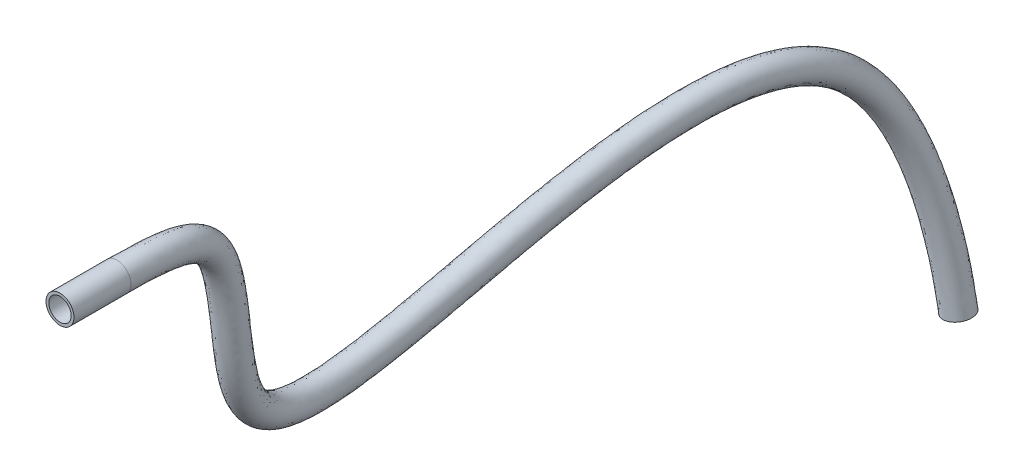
ISO-10303-21;
HEADER;
FILE_DESCRIPTION(('STEP AP214'),'2;1');
FILE_NAME('part.step','',(''),(''),'','','');
FILE_SCHEMA(('AUTOMOTIVE_DESIGN { 1 0 10303 214 1 1 1 1 }'));
ENDSEC;
DATA;
#1=APPLICATION_CONTEXT('core data for automotive mechanical design processes');
#2=APPLICATION_PROTOCOL_DEFINITION('international standard','automotive_design',2000,#1);
#3=PRODUCT_CONTEXT('',#1,'mechanical');
#4=PRODUCT('Part','Part','',(#3));
#5=PRODUCT_RELATED_PRODUCT_CATEGORY('part','',(#4));
#6=PRODUCT_DEFINITION_FORMATION('','',#4);
#7=PRODUCT_DEFINITION_CONTEXT('part definition',#1,'design');
#8=PRODUCT_DEFINITION('design','',#6,#7);
#9=PRODUCT_DEFINITION_SHAPE('','',#8);
#10=(LENGTH_UNIT() NAMED_UNIT(*) SI_UNIT(.MILLI.,.METRE.));
#11=(NAMED_UNIT(*) PLANE_ANGLE_UNIT() SI_UNIT($,.RADIAN.));
#12=(NAMED_UNIT(*) SI_UNIT($,.STERADIAN.) SOLID_ANGLE_UNIT());
#13=UNCERTAINTY_MEASURE_WITH_UNIT(LENGTH_MEASURE(1.E-05),#10,'distance_accuracy_value','');
#14=(GEOMETRIC_REPRESENTATION_CONTEXT(3) GLOBAL_UNCERTAINTY_ASSIGNED_CONTEXT((#13)) GLOBAL_UNIT_ASSIGNED_CONTEXT((#10,
#11,#12)) REPRESENTATION_CONTEXT('',''));
#15=CARTESIAN_POINT('',(0.,0.,0.));
#16=DIRECTION('',(0.,0.,1.));
#17=DIRECTION('',(1.,0.,0.));
#18=AXIS2_PLACEMENT_3D('',#15,#16,#17);
#19=CARTESIAN_POINT('',(0.388000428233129,-34.6703312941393,-37.5061323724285));
#20=DIRECTION('',(-0.9808861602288,0.173970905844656,0.0871576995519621));
#21=DIRECTION('',(-0.174635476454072,-0.984633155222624,0.));
#22=AXIS2_PLACEMENT_3D('',#19,#20,#21);
#23=CYLINDRICAL_SURFACE('',#22,0.0999999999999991);
#24=CARTESIAN_POINT('',(0.388000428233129,-34.6703312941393,-37.5061323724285));
#25=DIRECTION('',(0.9808861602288,-0.173970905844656,-0.0871576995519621));
#26=DIRECTION('',(0.174635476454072,0.984633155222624,0.));
#27=AXIS2_PLACEMENT_3D('',#24,#25,#26);
#28=CIRCLE('',#27,0.0999999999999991);
#29=CARTESIAN_POINT('',(0.405463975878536,-34.571867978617,-37.5061323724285));
#30=VERTEX_POINT('',#29);
#31=EDGE_CURVE('E11',#30,#30,#28,.T.);
#32=ORIENTED_EDGE('',*,*,#31,.F.);
#33=EDGE_LOOP('',(#32));
#34=FACE_BOUND('',#33,.T.);
#35=CARTESIAN_POINT('',(-2.55465805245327,-34.1484185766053,-37.2446592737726));
#36=DIRECTION('',(0.9808861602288,-0.173970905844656,-0.0871576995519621));
#37=DIRECTION('',(0.174635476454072,0.984633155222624,0.));
#38=AXIS2_PLACEMENT_3D('',#35,#36,#37);
#39=CIRCLE('',#38,0.0999999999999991);
#40=CARTESIAN_POINT('',(-2.53719450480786,-34.0499552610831,-37.2446592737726));
#41=VERTEX_POINT('',#40);
#42=EDGE_CURVE('E44',#41,#41,#39,.T.);
#43=ORIENTED_EDGE('',*,*,#42,.T.);
#44=EDGE_LOOP('',(#43));
#45=FACE_BOUND('',#44,.T.);
#46=ADVANCED_FACE('F41',(#34,#45),#23,.T.);
#47=CARTESIAN_POINT('',(0.388000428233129,-34.6703312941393,-37.5061323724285));
#48=DIRECTION('',(0.9808861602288,-0.173970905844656,-0.0871576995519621));
#49=DIRECTION('',(0.174635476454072,0.984633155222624,0.));
#50=AXIS2_PLACEMENT_3D('',#47,#48,#49);
#51=PLANE('',#50);
#52=ORIENTED_EDGE('',*,*,#31,.T.);
#53=EDGE_LOOP('',(#52));
#54=FACE_BOUND('',#53,.T.);
#55=ADVANCED_FACE('F56',(#54),#51,.T.);
#56=CARTESIAN_POINT('',(-2.55465805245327,-34.1484185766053,-37.2446592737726));
#57=DIRECTION('',(0.9808861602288,-0.173970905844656,-0.0871576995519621));
#58=DIRECTION('',(0.174635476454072,0.984633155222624,0.));
#59=AXIS2_PLACEMENT_3D('',#56,#57,#58);
#60=PLANE('',#59);
#61=ORIENTED_EDGE('',*,*,#42,.F.);
#62=EDGE_LOOP('',(#61));
#63=FACE_BOUND('',#62,.T.);
#64=ADVANCED_FACE('F54',(#63),#60,.F.);
#65=CLOSED_SHELL('',(#46,#55,#64));
#66=MANIFOLD_SOLID_BREP('B2',#65);
#67=CARTESIAN_POINT('',(2.49471120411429,-0.00429787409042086,-9.95385838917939));
#68=CARTESIAN_POINT('',(2.49625162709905,-0.00304606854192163,-10.0204954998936));
#69=CARTESIAN_POINT('',(2.49778812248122,-0.00179783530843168,-10.0869612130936));
#70=CARTESIAN_POINT('',(2.51521987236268,0.0123721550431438,-10.8410576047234));
#71=CARTESIAN_POINT('',(2.52913338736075,0.0475794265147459,-11.506614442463));
#72=CARTESIAN_POINT('',(2.5519785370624,0.101494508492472,-12.7880095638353));
#73=CARTESIAN_POINT('',(2.56115880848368,0.119157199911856,-13.4054337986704));
#74=CARTESIAN_POINT('',(2.58304703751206,0.144443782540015,-15.1909360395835));
#75=CARTESIAN_POINT('',(2.5901362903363,0.124459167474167,-16.2922262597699));
#76=CARTESIAN_POINT('',(2.59544963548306,-0.0485445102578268,-19.3541684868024));
#77=CARTESIAN_POINT('',(2.57782964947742,-0.313524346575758,-21.0734945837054));
#78=CARTESIAN_POINT('',(2.52645327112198,-1.18818828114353,-24.0008814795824));
#79=CARTESIAN_POINT('',(2.49249445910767,-1.80144283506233,-25.2103055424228));
#80=CARTESIAN_POINT('',(2.43180697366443,-3.42090311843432,-27.2062318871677));
#81=CARTESIAN_POINT('',(2.40573564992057,-4.42383442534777,-27.986362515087));
#82=CARTESIAN_POINT('',(2.38769433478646,-5.93415345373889,-28.7864669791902));
#83=CARTESIAN_POINT('',(2.39063849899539,-6.27881083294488,-28.9292106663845));
#84=CARTESIAN_POINT('',(2.39753315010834,-6.98933221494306,-29.1966289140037));
#85=CARTESIAN_POINT('',(2.40207671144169,-7.35649077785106,-29.31960591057));
#86=CARTESIAN_POINT('',(2.41825412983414,-8.48951448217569,-29.6608975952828));
#87=CARTESIAN_POINT('',(2.43242779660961,-9.28693804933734,-29.8516449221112));
#88=CARTESIAN_POINT('',(2.47943335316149,-11.7729631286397,-30.3470438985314));
#89=CARTESIAN_POINT('',(2.51674412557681,-13.5556733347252,-30.5750939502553));
#90=CARTESIAN_POINT('',(2.573988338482,-17.192975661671,-30.989743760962));
#91=CARTESIAN_POINT('',(2.59392915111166,-19.0474603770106,-31.1760873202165));
#92=CARTESIAN_POINT('',(2.58744488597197,-22.6417378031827,-31.6631739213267));
#93=CARTESIAN_POINT('',(2.56098059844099,-24.3814732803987,-31.9640378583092));
#94=CARTESIAN_POINT('',(2.42857377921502,-27.6742460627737,-32.8645334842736));
#95=CARTESIAN_POINT('',(2.31718743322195,-29.1949416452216,-33.4832151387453));
#96=CARTESIAN_POINT('',(2.05447401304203,-31.8130893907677,-35.0692473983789));
#97=CARTESIAN_POINT('',(1.90342786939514,-32.9104229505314,-36.0343307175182));
#98=CARTESIAN_POINT('',(1.61710913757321,-34.5734049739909,-38.2469054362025));
#99=CARTESIAN_POINT('',(1.47965334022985,-35.1950947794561,-39.4695253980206));
#100=CARTESIAN_POINT('',(1.20332633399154,-36.1495382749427,-42.2487730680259));
#101=CARTESIAN_POINT('',(1.06456145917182,-36.4815017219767,-43.8047833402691));
#102=CARTESIAN_POINT('',(0.65415156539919,-37.094634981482,-48.9064419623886));
#103=CARTESIAN_POINT('',(0.388649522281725,-36.9916285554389,-52.8839021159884));
#104=CARTESIAN_POINT('',(-0.0880999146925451,-36.1134766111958,-61.6177943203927));
#105=CARTESIAN_POINT('',(-0.29947639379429,-35.3398392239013,-66.3744715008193));
#106=CARTESIAN_POINT('',(-0.633484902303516,-33.4990489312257,-76.3117549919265));
#107=CARTESIAN_POINT('',(-0.756153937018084,-32.4320988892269,-81.4926431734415));
#108=CARTESIAN_POINT('',(-0.940414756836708,-29.3595878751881,-97.1503773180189));
#109=CARTESIAN_POINT('',(-0.818099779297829,-27.4830451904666,-107.742458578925));
#110=CARTESIAN_POINT('',(-0.0670820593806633,-27.195570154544,-121.790154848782));
#111=CARTESIAN_POINT('',(0.277804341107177,-27.5209073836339,-126.165857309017));
#112=CARTESIAN_POINT('',(1.18909126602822,-29.3881410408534,-133.960306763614));
#113=CARTESIAN_POINT('',(1.75528726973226,-30.9292489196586,-137.378633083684));
#114=CARTESIAN_POINT('',(3.04192049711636,-35.2638219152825,-142.523736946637));
#115=CARTESIAN_POINT('',(3.72980084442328,-37.8489647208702,-144.430667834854));
#116=CARTESIAN_POINT('',(5.18069094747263,-43.787843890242,-147.497217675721));
#117=CARTESIAN_POINT('',(5.94351742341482,-47.1408313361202,-148.656595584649));
#118=CARTESIAN_POINT('',(8.16925721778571,-57.7276663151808,-151.292521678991));
#119=CARTESIAN_POINT('',(9.56949049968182,-65.4822033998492,-151.926911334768));
#120=CARTESIAN_POINT('',(10.4221801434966,-72.3163769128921,-152.202745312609));
#121=CARTESIAN_POINT('',(2.49362628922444,4.99482048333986,-9.85997297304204));
#122=CARTESIAN_POINT('',(2.49516671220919,4.99607228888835,-9.92661008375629));
#123=CARTESIAN_POINT('',(2.49667026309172,4.99729294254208,-9.99160730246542));
#124=CARTESIAN_POINT('',(2.51447387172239,5.01177423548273,-10.7622792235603));
#125=CARTESIAN_POINT('',(2.47156124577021,5.0476082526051,-11.4775088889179));
#126=CARTESIAN_POINT('',(2.3845805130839,5.09891947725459,-12.8346092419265));
#127=CARTESIAN_POINT('',(2.34326507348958,5.11406276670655,-13.4932066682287));
#128=CARTESIAN_POINT('',(2.22417297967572,5.1282568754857,-15.41425190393));
#129=CARTESIAN_POINT('',(2.15116204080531,5.09644973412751,-16.621876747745));
#130=CARTESIAN_POINT('',(1.94207078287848,4.86559657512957,-20.070091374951));
#131=CARTESIAN_POINT('',(1.81540330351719,4.53858659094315,-22.1433005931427));
#132=CARTESIAN_POINT('',(1.5623208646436,3.31113313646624,-26.0245698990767));
#133=CARTESIAN_POINT('',(1.43550556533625,2.37767924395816,-27.8475266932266));
#134=CARTESIAN_POINT('',(1.18421876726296,-0.223469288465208,-30.9152968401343));
#135=CARTESIAN_POINT('',(1.06475575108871,-1.85683422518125,-32.1017587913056));
#136=CARTESIAN_POINT('',(0.89963118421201,-4.02575724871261,-33.1645538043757));
#137=CARTESIAN_POINT('',(0.907658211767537,-4.49500121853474,-33.3602054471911));
#138=CARTESIAN_POINT('',(0.916767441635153,-5.43416683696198,-33.7136761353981));
#139=CARTESIAN_POINT('',(0.922618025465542,-5.90474518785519,-33.870777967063));
#140=CARTESIAN_POINT('',(0.942794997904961,-7.31816792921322,-34.296530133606));
#141=CARTESIAN_POINT('',(0.959681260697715,-8.26287768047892,-34.5203204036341));
#142=CARTESIAN_POINT('',(1.01330040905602,-11.0995994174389,-35.0855971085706));
#143=CARTESIAN_POINT('',(1.05291241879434,-12.998442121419,-35.3235872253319));
#144=CARTESIAN_POINT('',(1.11134114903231,-16.7126533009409,-35.7469963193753));
#145=CARTESIAN_POINT('',(1.13010780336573,-18.5271505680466,-35.9302685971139));
#146=CARTESIAN_POINT('',(1.12404540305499,-21.8728244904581,-36.3836579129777));
#147=CARTESIAN_POINT('',(1.09830025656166,-23.4031672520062,-36.6572858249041));
#148=CARTESIAN_POINT('',(0.99411554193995,-25.9940930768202,-37.3658428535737));
#149=CARTESIAN_POINT('',(0.911514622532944,-27.0754569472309,-37.8236638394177));
#150=CARTESIAN_POINT('',(0.743567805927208,-28.7483063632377,-38.8370393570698));
#151=CARTESIAN_POINT('',(0.659363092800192,-29.3456236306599,-39.3771246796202));
#152=CARTESIAN_POINT('',(0.500704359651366,-30.2671360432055,-40.6031842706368));
#153=CARTESIAN_POINT('',(0.414109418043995,-30.6714937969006,-41.3605700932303));
#154=CARTESIAN_POINT('',(0.215975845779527,-31.3558490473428,-43.3533464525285));
#155=CARTESIAN_POINT('',(0.10541636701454,-31.628950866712,-44.582735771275));
#156=CARTESIAN_POINT('',(-0.240735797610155,-32.1460584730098,-48.8853813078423));
#157=CARTESIAN_POINT('',(-0.488443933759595,-32.0755071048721,-52.5557652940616));
#158=CARTESIAN_POINT('',(-0.942141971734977,-31.2398404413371,-60.8671283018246));
#159=CARTESIAN_POINT('',(-1.14938888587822,-30.48845435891,-65.5109687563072));
#160=CARTESIAN_POINT('',(-1.47926588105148,-28.6704702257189,-75.325141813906));
#161=CARTESIAN_POINT('',(-1.60228508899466,-27.6055325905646,-80.4978099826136));
#162=CARTESIAN_POINT('',(-1.78786541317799,-24.5116223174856,-96.2646288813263));
#163=CARTESIAN_POINT('',(-1.67337298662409,-22.5639559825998,-107.079199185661));
#164=CARTESIAN_POINT('',(-0.873735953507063,-22.2578696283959,-122.036394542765));
#165=CARTESIAN_POINT('',(-0.501934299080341,-22.5906090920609,-126.825274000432));
#166=CARTESIAN_POINT('',(0.543143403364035,-24.7319899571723,-135.764100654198));
#167=CARTESIAN_POINT('',(1.22532507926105,-26.5707203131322,-139.945155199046));
#168=CARTESIAN_POINT('',(2.83589036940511,-31.9965968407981,-146.385627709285));
#169=CARTESIAN_POINT('',(3.66309045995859,-35.117776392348,-148.647450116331));
#170=CARTESIAN_POINT('',(5.32401404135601,-41.9164104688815,-152.157935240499));
#171=CARTESIAN_POINT('',(6.16242821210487,-45.6098737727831,-153.419897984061));
#172=CARTESIAN_POINT('',(8.55858821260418,-57.0075270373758,-156.257703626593));
#173=CARTESIAN_POINT('',(10.0039552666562,-65.0525007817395,-156.892465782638));
#174=CARTESIAN_POINT('',(10.8781201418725,-72.0587949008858,-157.175246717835));
#175=CARTESIAN_POINT('',(-2.50503865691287,4.99590539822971,-9.97550469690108));
#176=CARTESIAN_POINT('',(-2.50349823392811,4.99715720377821,-10.0421418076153));
#177=CARTESIAN_POINT('',(-2.50198673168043,4.99838531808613,-10.10748300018));
#178=CARTESIAN_POINT('',(-2.484272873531,5.01278239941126,-10.874272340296));
#179=CARTESIAN_POINT('',(-2.52738830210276,4.99058287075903,-11.5795467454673));
#180=CARTESIAN_POINT('',(-2.61217065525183,4.9306857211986,-12.9202559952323));
#181=CARTESIAN_POINT('',(-2.65158119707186,4.89474767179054,-13.5692578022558));
#182=CARTESIAN_POINT('',(-2.76351456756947,4.76683357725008,-15.4570857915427));
#183=CARTESIAN_POINT('',(-2.82989541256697,4.65494941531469,-16.6366932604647));
#184=CARTESIAN_POINT('',(-3.01722768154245,4.21636325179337,-19.9797780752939));
#185=CARTESIAN_POINT('',(-3.1271182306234,3.79201722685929,-21.9535921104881));
#186=CARTESIAN_POINT('',(-3.34432395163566,2.45485364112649,-25.5625132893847));
#187=CARTESIAN_POINT('',(-3.45163462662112,1.51616657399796,-27.2097905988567));
#188=CARTESIAN_POINT('',(-3.658165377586,-1.00216815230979,-29.9263607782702));
#189=CARTESIAN_POINT('',(-3.75369167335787,-2.55403494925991,-30.950045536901));
#190=CARTESIAN_POINT('',(-3.87386131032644,-4.64625733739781,-31.8114229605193));
#191=CARTESIAN_POINT('',(-3.86722717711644,-5.08420336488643,-31.9985451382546));
#192=CARTESIAN_POINT('',(-3.85863308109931,-5.97015106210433,-32.3319818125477));
#193=CARTESIAN_POINT('',(-3.85309088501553,-6.41622031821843,-32.4809742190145));
#194=CARTESIAN_POINT('',(-3.8338804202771,-7.76186506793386,-32.8863059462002));
#195=CARTESIAN_POINT('',(-3.81767977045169,-8.6690344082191,-33.1015491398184));
#196=CARTESIAN_POINT('',(-3.76586067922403,-11.410275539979,-33.6477813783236));
#197=CARTESIAN_POINT('',(-3.72709498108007,-13.2676100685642,-33.8813880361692));
#198=CARTESIAN_POINT('',(-3.66957571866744,-16.9235358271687,-34.298126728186));
#199=CARTESIAN_POINT('',(-3.65088696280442,-18.721470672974,-34.4796244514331));
#200=CARTESIAN_POINT('',(-3.65691878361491,-22.0546615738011,-34.931295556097));
#201=CARTESIAN_POINT('',(-3.6824770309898,-23.5891982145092,-35.204738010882));
#202=CARTESIAN_POINT('',(-3.78813213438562,-26.2166913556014,-35.9232952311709));
#203=CARTESIAN_POINT('',(-3.87333612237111,-27.3492269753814,-36.3956482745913));
#204=CARTESIAN_POINT('',(-4.0574604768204,-29.1835871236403,-37.5067637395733));
#205=CARTESIAN_POINT('',(-4.15580152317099,-29.8914805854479,-38.134591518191));
#206=CARTESIAN_POINT('',(-4.34684621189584,-31.0010959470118,-39.6109191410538));
#207=CARTESIAN_POINT('',(-4.44662073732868,-31.4620983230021,-40.4885409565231));
#208=CARTESIAN_POINT('',(-4.66542546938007,-32.2178551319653,-42.6892269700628));
#209=CARTESIAN_POINT('',(-4.78368919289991,-32.5072943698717,-44.0075248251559));
#210=CARTESIAN_POINT('',(-5.14788346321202,-33.0513816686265,-48.5344907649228));
#211=CARTESIAN_POINT('',(-5.40137532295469,-32.9722783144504,-52.3015134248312));
#212=CARTESIAN_POINT('',(-5.86328686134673,-32.1214913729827,-60.763387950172));
#213=CARTESIAN_POINT('',(-6.07270538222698,-31.3605207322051,-65.460610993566));
#214=CARTESIAN_POINT('',(-6.40559490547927,-29.5259341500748,-75.3644458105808));
#215=CARTESIAN_POINT('',(-6.52938102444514,-28.4535728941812,-80.5728294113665));
#216=CARTESIAN_POINT('',(-6.71609076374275,-25.3407621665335,-96.4361529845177));
#217=CARTESIAN_POINT('',(-6.60111048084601,-23.3836310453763,-107.300539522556));
#218=CARTESIAN_POINT('',(-5.79676635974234,-23.0757475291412,-122.345766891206));
#219=CARTESIAN_POINT('',(-5.42264569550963,-23.4100764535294,-127.166459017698));
#220=CARTESIAN_POINT('',(-4.36931327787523,-25.5683739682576,-136.175884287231));
#221=CARTESIAN_POINT('',(-3.68078685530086,-27.4240086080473,-140.396566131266));
#222=CARTESIAN_POINT('',(-2.05541290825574,-32.8997744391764,-146.896256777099));
#223=CARTESIAN_POINT('',(-1.22391156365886,-36.0383238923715,-149.166895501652));
#224=CARTESIAN_POINT('',(0.438908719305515,-42.8447254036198,-152.681382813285));
#225=CARTESIAN_POINT('',(1.27528489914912,-46.5300840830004,-153.939013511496));
#226=CARTESIAN_POINT('',(3.65889653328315,-57.8680723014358,-156.761919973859));
#227=CARTESIAN_POINT('',(5.08719962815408,-65.8405006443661,-157.384113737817));
#228=CARTESIAN_POINT('',(5.93752114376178,-72.6556939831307,-157.659181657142));
#229=CARTESIAN_POINT('',(-2.50395374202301,-0.00321295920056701,-10.0693901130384));
#230=CARTESIAN_POINT('',(-2.50241331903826,-0.00196115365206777,-10.1360272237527));
#231=CARTESIAN_POINT('',(-2.50086887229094,-0.000705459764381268,-10.2028369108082));
#232=CARTESIAN_POINT('',(-2.48352687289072,0.013380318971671,-10.9530507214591));
#233=CARTESIAN_POINT('',(-2.46981616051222,-0.00944595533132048,-11.6086522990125));
#234=CARTESIAN_POINT('',(-2.44477263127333,-0.0667392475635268,-12.8736563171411));
#235=CARTESIAN_POINT('',(-2.43368746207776,-0.100157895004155,-13.4814849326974));
#236=CARTESIAN_POINT('',(-2.40464050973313,-0.216979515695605,-15.2337699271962));
#237=CARTESIAN_POINT('',(-2.39092116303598,-0.31704115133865,-16.3070427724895));
#238=CARTESIAN_POINT('',(-2.36384882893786,-0.697777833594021,-19.2638551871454));
#239=CARTESIAN_POINT('',(-2.36469188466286,-1.06009371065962,-20.8837861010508));
#240=CARTESIAN_POINT('',(-2.3801915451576,-2.04446777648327,-23.5388248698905));
#241=CARTESIAN_POINT('',(-2.39464573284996,-2.66295550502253,-24.5725694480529));
#242=CARTESIAN_POINT('',(-2.41057717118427,-4.1996019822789,-26.2172958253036));
#243=CARTESIAN_POINT('',(-2.41271177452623,-5.12103514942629,-26.8346492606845));
#244=CARTESIAN_POINT('',(-2.38579815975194,-6.55465354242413,-27.4333361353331));
#245=CARTESIAN_POINT('',(-2.38424688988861,-6.86801297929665,-27.5675503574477));
#246=CARTESIAN_POINT('',(-2.3778673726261,-7.52531644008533,-27.8149345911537));
#247=CARTESIAN_POINT('',(-2.37363219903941,-7.86796590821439,-27.9298021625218));
#248=CARTESIAN_POINT('',(-2.35842128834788,-8.93321162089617,-28.2506734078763));
#249=CARTESIAN_POINT('',(-2.34493323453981,-9.69309477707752,-28.4328736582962));
#250=CARTESIAN_POINT('',(-2.29972773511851,-12.0836392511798,-28.909228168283));
#251=CARTESIAN_POINT('',(-2.26326327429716,-13.8248412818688,-29.1328947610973));
#252=CARTESIAN_POINT('',(-2.20692852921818,-17.4038581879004,-29.540874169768));
#253=CARTESIAN_POINT('',(-2.18706561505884,-19.2417804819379,-29.7254431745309));
#254=CARTESIAN_POINT('',(-2.19351930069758,-22.8235748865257,-30.2108115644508));
#255=CARTESIAN_POINT('',(-2.21979668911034,-24.5675042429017,-30.5114900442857));
#256=CARTESIAN_POINT('',(-2.35367389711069,-27.896844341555,-31.4219858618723));
#257=CARTESIAN_POINT('',(-2.46766331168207,-29.468711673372,-32.0551995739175));
#258=CARTESIAN_POINT('',(-2.74655426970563,-32.2483701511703,-33.7389717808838));
#259=CARTESIAN_POINT('',(-2.91173674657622,-33.4562799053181,-34.7917975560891));
#260=CARTESIAN_POINT('',(-3.23044143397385,-35.3073648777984,-37.2546403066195));
#261=CARTESIAN_POINT('',(-3.38107681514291,-35.9856993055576,-38.5974962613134));
#262=CARTESIAN_POINT('',(-3.67807498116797,-37.0115443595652,-41.5846535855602));
#263=CARTESIAN_POINT('',(-3.82454410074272,-37.3598452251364,-43.22957239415));
#264=CARTESIAN_POINT('',(-4.25299610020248,-37.9999581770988,-48.5555514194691));
#265=CARTESIAN_POINT('',(-4.52428186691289,-37.8883997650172,-52.629650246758));
#266=CARTESIAN_POINT('',(-5.00924480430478,-36.9951275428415,-61.5140539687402));
#267=CARTESIAN_POINT('',(-5.22279289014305,-36.2119055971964,-66.3241137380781));
#268=CARTESIAN_POINT('',(-5.5598139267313,-34.3545128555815,-76.3510589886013));
#269=CARTESIAN_POINT('',(-5.68324987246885,-33.2801391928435,-81.5676626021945));
#270=CARTESIAN_POINT('',(-5.86864010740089,-30.1887277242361,-97.3219014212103));
#271=CARTESIAN_POINT('',(-5.74583727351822,-28.3027202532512,-107.963798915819));
#272=CARTESIAN_POINT('',(-4.99011246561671,-28.0134480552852,-122.099527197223));
#273=CARTESIAN_POINT('',(-4.64290705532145,-28.3403747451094,-126.507042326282));
#274=CARTESIAN_POINT('',(-3.72336541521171,-30.2245250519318,-134.372090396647));
#275=CARTESIAN_POINT('',(-3.15082466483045,-31.7825372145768,-137.830044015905));
#276=CARTESIAN_POINT('',(-1.84938278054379,-36.1669995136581,-143.034366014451));
#277=CARTESIAN_POINT('',(-1.15720117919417,-38.7695122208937,-144.950113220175));
#278=CARTESIAN_POINT('',(0.295585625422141,-44.7161588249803,-148.020665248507));
#279=CARTESIAN_POINT('',(1.05637411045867,-48.0610416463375,-149.175711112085));
#280=CARTESIAN_POINT('',(3.26956553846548,-58.5882115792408,-151.796738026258));
#281=CARTESIAN_POINT('',(4.65273486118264,-66.2702032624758,-152.418559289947));
#282=CARTESIAN_POINT('',(5.48158114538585,-72.9132759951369,-152.686680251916));
#283=CARTESIAN_POINT('',(-2.50286882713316,-5.00233131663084,-10.1632755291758));
#284=CARTESIAN_POINT('',(-2.5013284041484,-5.00107951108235,-10.22991263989));
#285=CARTESIAN_POINT('',(-2.49975101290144,-4.99979623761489,-10.2981908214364));
#286=CARTESIAN_POINT('',(-2.48278087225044,-4.98602176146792,-11.0318291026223));
#287=CARTESIAN_POINT('',(-2.41224401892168,-5.00947478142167,-11.6377578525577));
#288=CARTESIAN_POINT('',(-2.27737460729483,-5.06416421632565,-12.8270566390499));
#289=CARTESIAN_POINT('',(-2.21579372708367,-5.09506346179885,-13.3937120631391));
#290=CARTESIAN_POINT('',(-2.04576645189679,-5.20079260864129,-15.0104540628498));
#291=CARTESIAN_POINT('',(-1.95194691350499,-5.28903171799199,-15.9773922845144));
#292=CARTESIAN_POINT('',(-1.71046997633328,-5.61191891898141,-18.5479322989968));
#293=CARTESIAN_POINT('',(-1.60226553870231,-5.91220464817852,-19.8139800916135));
#294=CARTESIAN_POINT('',(-1.41605913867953,-6.54378919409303,-21.5151364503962));
#295=CARTESIAN_POINT('',(-1.33765683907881,-6.84207758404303,-21.9353482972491));
#296=CARTESIAN_POINT('',(-1.16298896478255,-7.39703581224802,-22.508230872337));
#297=CARTESIAN_POINT('',(-1.07173187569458,-7.68803534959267,-22.7192529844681));
#298=CARTESIAN_POINT('',(-0.897735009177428,-8.46304974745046,-23.055249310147));
#299=CARTESIAN_POINT('',(-0.901266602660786,-8.65182259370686,-23.1365555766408));
#300=CARTESIAN_POINT('',(-0.897101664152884,-9.08048181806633,-23.2978873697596));
#301=CARTESIAN_POINT('',(-0.894173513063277,-9.31971149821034,-23.3786301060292));
#302=CARTESIAN_POINT('',(-0.882962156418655,-10.1045581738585,-23.6150408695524));
#303=CARTESIAN_POINT('',(-0.872186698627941,-10.7171551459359,-23.7641981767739));
#304=CARTESIAN_POINT('',(-0.833594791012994,-12.7570029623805,-24.1706749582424));
#305=CARTESIAN_POINT('',(-0.799431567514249,-14.3820724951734,-24.3844014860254));
#306=CARTESIAN_POINT('',(-0.744281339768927,-17.8841805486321,-24.7836216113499));
#307=CARTESIAN_POINT('',(-0.72324426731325,-19.7620902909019,-24.9712618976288));
#308=CARTESIAN_POINT('',(-0.730119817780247,-23.5924881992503,-25.4903275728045));
#309=CARTESIAN_POINT('',(-0.757116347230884,-25.5458102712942,-25.8182420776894));
#310=CARTESIAN_POINT('',(-0.919215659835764,-29.5769973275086,-26.9206764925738));
#311=CARTESIAN_POINT('',(-1.06199050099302,-31.5881963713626,-27.7147508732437));
#312=CARTESIAN_POINT('',(-1.43564806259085,-35.3131531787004,-29.9711798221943));
#313=CARTESIAN_POINT('',(-1.66767196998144,-37.0210792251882,-31.4490035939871));
#314=CARTESIAN_POINT('',(-2.11403665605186,-39.6136338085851,-34.8983614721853));
#315=CARTESIAN_POINT('',(-2.31553289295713,-40.5093002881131,-36.7064515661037));
#316=CARTESIAN_POINT('',(-2.69072449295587,-41.805233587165,-40.4800802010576));
#317=CARTESIAN_POINT('',(-2.86539900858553,-42.212396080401,-42.4516199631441));
#318=CARTESIAN_POINT('',(-3.35810873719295,-42.9485346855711,-48.5766120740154));
#319=CARTESIAN_POINT('',(-3.64718841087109,-42.804521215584,-52.9577870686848));
#320=CARTESIAN_POINT('',(-4.15520274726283,-41.8687637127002,-62.2647199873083));
#321=CARTESIAN_POINT('',(-4.37288039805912,-41.0632904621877,-67.1876164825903));
#322=CARTESIAN_POINT('',(-4.71403294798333,-39.1830915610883,-77.3376721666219));
#323=CARTESIAN_POINT('',(-4.83711872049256,-38.1067054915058,-82.5624957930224));
#324=CARTESIAN_POINT('',(-5.02118945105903,-35.0366932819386,-98.2076498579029));
#325=CARTESIAN_POINT('',(-4.89056406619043,-33.2218094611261,-108.627058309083));
#326=CARTESIAN_POINT('',(-4.18345857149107,-32.9511485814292,-121.853287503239));
#327=CARTESIAN_POINT('',(-3.86316841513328,-33.2706730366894,-125.847625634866));
#328=CARTESIAN_POINT('',(-3.07741755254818,-34.8806761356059,-132.568296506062));
#329=CARTESIAN_POINT('',(-2.62086247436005,-36.1410658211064,-135.263521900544));
#330=CARTESIAN_POINT('',(-1.64335265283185,-39.4342245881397,-139.172475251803));
#331=CARTESIAN_POINT('',(-1.09049079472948,-41.5007005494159,-140.733330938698));
#332=CARTESIAN_POINT('',(0.152262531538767,-46.5875922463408,-143.359947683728));
#333=CARTESIAN_POINT('',(0.837463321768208,-49.5919992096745,-144.412408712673));
#334=CARTESIAN_POINT('',(2.8802345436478,-59.3083508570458,-146.831556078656));
#335=CARTESIAN_POINT('',(4.21827009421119,-66.6999058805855,-147.453004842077));
#336=CARTESIAN_POINT('',(5.02564114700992,-73.1708580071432,-147.714178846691));
#337=CARTESIAN_POINT('',(2.49579611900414,-5.0034162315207,-10.0477438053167));
#338=CARTESIAN_POINT('',(2.4973365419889,-5.0021644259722,-10.114380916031));
#339=CARTESIAN_POINT('',(2.49890598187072,-5.00088861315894,-10.1823151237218));
#340=CARTESIAN_POINT('',(2.51596587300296,-4.98702992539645,-10.9198359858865));
#341=CARTESIAN_POINT('',(2.58670552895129,-4.95244939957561,-11.5357199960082));
#342=CARTESIAN_POINT('',(2.7193765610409,-4.89593046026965,-12.7414098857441));
#343=CARTESIAN_POINT('',(2.77905254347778,-4.87574836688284,-13.3176609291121));
#344=CARTESIAN_POINT('',(2.9419210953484,-4.83936931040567,-14.9676201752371));
#345=CARTESIAN_POINT('',(3.02911053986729,-4.84753139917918,-15.9625757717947));
#346=CARTESIAN_POINT('',(3.24882848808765,-4.96268559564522,-18.6382455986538));
#347=CARTESIAN_POINT('',(3.34025599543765,-5.16563528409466,-20.0036885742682));
#348=CARTESIAN_POINT('',(3.49058567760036,-5.68750969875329,-21.9771930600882));
#349=CARTESIAN_POINT('',(3.54948335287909,-5.98056491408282,-22.573084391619));
#350=CARTESIAN_POINT('',(3.6793951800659,-6.61833694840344,-23.4971669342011));
#351=CARTESIAN_POINT('',(3.74671554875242,-6.99083462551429,-23.8709662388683));
#352=CARTESIAN_POINT('',(3.87575748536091,-7.84254965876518,-24.4083801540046));
#353=CARTESIAN_POINT('',(3.87361878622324,-8.06262044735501,-24.4982158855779));
#354=CARTESIAN_POINT('',(3.87829885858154,-8.54449759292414,-24.6795816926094));
#355=CARTESIAN_POINT('',(3.88153539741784,-8.80823636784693,-24.768433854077));
#356=CARTESIAN_POINT('',(3.89371326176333,-9.66086103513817,-25.0252650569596));
#357=CARTESIAN_POINT('',(3.90517433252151,-10.3109984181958,-25.1829694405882));
#358=CARTESIAN_POINT('',(3.94556629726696,-12.4463268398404,-25.6084906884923));
#359=CARTESIAN_POINT('',(3.98057583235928,-14.1129045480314,-25.8266006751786));
#360=CARTESIAN_POINT('',(4.0366355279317,-17.6732980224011,-26.2324912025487));
#361=CARTESIAN_POINT('',(4.05775049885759,-19.5677701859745,-26.4219060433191));
#362=CARTESIAN_POINT('',(4.05084436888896,-23.4106511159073,-26.9426899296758));
#363=CARTESIAN_POINT('',(4.02366094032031,-25.3597793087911,-27.2707898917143));
#364=CARTESIAN_POINT('',(3.8630320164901,-29.3543990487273,-28.3632241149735));
#365=CARTESIAN_POINT('',(3.72286024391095,-31.3144263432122,-29.1427664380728));
#366=CARTESIAN_POINT('',(3.36538022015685,-34.8778724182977,-31.301455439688));
#367=CARTESIAN_POINT('',(3.14749264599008,-36.4752222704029,-32.6915367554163));
#368=CARTESIAN_POINT('',(2.73351391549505,-38.8796739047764,-35.8906266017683));
#369=CARTESIAN_POINT('',(2.54519726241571,-39.7186957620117,-37.5784807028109));
#370=CARTESIAN_POINT('',(2.19067682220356,-40.9432275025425,-41.1441996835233));
#371=CARTESIAN_POINT('',(2.02370655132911,-41.3340525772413,-43.0268309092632));
#372=CARTESIAN_POINT('',(1.54903892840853,-42.0432114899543,-48.9275026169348));
#373=CARTESIAN_POINT('',(1.26574297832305,-41.9077500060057,-53.2120389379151));
#374=CARTESIAN_POINT('',(0.765942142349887,-40.9871127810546,-62.3684603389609));
#375=CARTESIAN_POINT('',(0.55043609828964,-40.1912240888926,-67.2379742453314));
#376=CARTESIAN_POINT('',(0.212296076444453,-38.3276276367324,-77.2983681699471));
#377=CARTESIAN_POINT('',(0.0899772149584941,-37.2586651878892,-82.4874763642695));
#378=CARTESIAN_POINT('',(-0.092964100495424,-34.2075534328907,-98.0361257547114));
#379=CARTESIAN_POINT('',(0.0371734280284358,-32.4021343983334,-108.405717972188));
#380=CARTESIAN_POINT('',(0.739571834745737,-32.1332706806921,-121.543915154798));
#381=CARTESIAN_POINT('',(1.05754298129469,-32.4512056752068,-125.506440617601));
#382=CARTESIAN_POINT('',(1.8350391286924,-34.0442921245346,-132.15651287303));
#383=CARTESIAN_POINT('',(2.28524946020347,-35.2877775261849,-134.812110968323));
#384=CARTESIAN_POINT('',(3.24795062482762,-38.5310469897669,-138.661846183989));
#385=CARTESIAN_POINT('',(3.79651122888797,-40.5801530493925,-140.213885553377));
#386=CARTESIAN_POINT('',(5.03736785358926,-45.6592773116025,-142.836500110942));
#387=CARTESIAN_POINT('',(5.72460663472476,-48.6717888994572,-143.893293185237));
#388=CARTESIAN_POINT('',(7.77992622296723,-58.4478055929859,-146.327339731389));
#389=CARTESIAN_POINT('',(9.13502573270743,-65.9119060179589,-146.961356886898));
#390=CARTESIAN_POINT('',(9.96624014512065,-72.5739589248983,-147.230243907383));
#391=CARTESIAN_POINT('',(2.49471120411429,-0.00429787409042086,-9.95385838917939));
#392=CARTESIAN_POINT('',(2.49625162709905,-0.00304606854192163,-10.0204954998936));
#393=CARTESIAN_POINT('',(2.49778812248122,-0.00179783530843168,-10.0869612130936));
#394=CARTESIAN_POINT('',(2.51521987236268,0.0123721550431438,-10.8410576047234));
#395=CARTESIAN_POINT('',(2.52913338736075,0.0475794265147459,-11.506614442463));
#396=CARTESIAN_POINT('',(2.5519785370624,0.101494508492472,-12.7880095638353));
#397=CARTESIAN_POINT('',(2.56115880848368,0.119157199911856,-13.4054337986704));
#398=CARTESIAN_POINT('',(2.58304703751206,0.144443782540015,-15.1909360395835));
#399=CARTESIAN_POINT('',(2.5901362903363,0.124459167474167,-16.2922262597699));
#400=CARTESIAN_POINT('',(2.59544963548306,-0.0485445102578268,-19.3541684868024));
#401=CARTESIAN_POINT('',(2.57782964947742,-0.313524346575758,-21.0734945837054));
#402=CARTESIAN_POINT('',(2.52645327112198,-1.18818828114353,-24.0008814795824));
#403=CARTESIAN_POINT('',(2.49249445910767,-1.80144283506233,-25.2103055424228));
#404=CARTESIAN_POINT('',(2.43180697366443,-3.42090311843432,-27.2062318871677));
#405=CARTESIAN_POINT('',(2.40573564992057,-4.42383442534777,-27.986362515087));
#406=CARTESIAN_POINT('',(2.38769433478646,-5.93415345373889,-28.7864669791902));
#407=CARTESIAN_POINT('',(2.39063849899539,-6.27881083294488,-28.9292106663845));
#408=CARTESIAN_POINT('',(2.39753315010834,-6.98933221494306,-29.1966289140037));
#409=CARTESIAN_POINT('',(2.40207671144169,-7.35649077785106,-29.31960591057));
#410=CARTESIAN_POINT('',(2.41825412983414,-8.48951448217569,-29.6608975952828));
#411=CARTESIAN_POINT('',(2.43242779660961,-9.28693804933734,-29.8516449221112));
#412=CARTESIAN_POINT('',(2.47943335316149,-11.7729631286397,-30.3470438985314));
#413=CARTESIAN_POINT('',(2.51674412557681,-13.5556733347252,-30.5750939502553));
#414=CARTESIAN_POINT('',(2.573988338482,-17.192975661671,-30.989743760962));
#415=CARTESIAN_POINT('',(2.59392915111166,-19.0474603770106,-31.1760873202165));
#416=CARTESIAN_POINT('',(2.58744488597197,-22.6417378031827,-31.6631739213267));
#417=CARTESIAN_POINT('',(2.56098059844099,-24.3814732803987,-31.9640378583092));
#418=CARTESIAN_POINT('',(2.42857377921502,-27.6742460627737,-32.8645334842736));
#419=CARTESIAN_POINT('',(2.31718743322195,-29.1949416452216,-33.4832151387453));
#420=CARTESIAN_POINT('',(2.05447401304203,-31.8130893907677,-35.0692473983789));
#421=CARTESIAN_POINT('',(1.90342786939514,-32.9104229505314,-36.0343307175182));
#422=CARTESIAN_POINT('',(1.61710913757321,-34.5734049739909,-38.2469054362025));
#423=CARTESIAN_POINT('',(1.47965334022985,-35.1950947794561,-39.4695253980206));
#424=CARTESIAN_POINT('',(1.20332633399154,-36.1495382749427,-42.2487730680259));
#425=CARTESIAN_POINT('',(1.06456145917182,-36.4815017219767,-43.8047833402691));
#426=CARTESIAN_POINT('',(0.65415156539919,-37.094634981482,-48.9064419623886));
#427=CARTESIAN_POINT('',(0.388649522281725,-36.9916285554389,-52.8839021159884));
#428=CARTESIAN_POINT('',(-0.0880999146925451,-36.1134766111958,-61.6177943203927));
#429=CARTESIAN_POINT('',(-0.29947639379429,-35.3398392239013,-66.3744715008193));
#430=CARTESIAN_POINT('',(-0.633484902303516,-33.4990489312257,-76.3117549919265));
#431=CARTESIAN_POINT('',(-0.756153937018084,-32.4320988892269,-81.4926431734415));
#432=CARTESIAN_POINT('',(-0.940414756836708,-29.3595878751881,-97.1503773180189));
#433=CARTESIAN_POINT('',(-0.818099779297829,-27.4830451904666,-107.742458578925));
#434=CARTESIAN_POINT('',(-0.0670820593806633,-27.195570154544,-121.790154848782));
#435=CARTESIAN_POINT('',(0.277804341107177,-27.5209073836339,-126.165857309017));
#436=CARTESIAN_POINT('',(1.18909126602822,-29.3881410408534,-133.960306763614));
#437=CARTESIAN_POINT('',(1.75528726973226,-30.9292489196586,-137.378633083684));
#438=CARTESIAN_POINT('',(3.04192049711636,-35.2638219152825,-142.523736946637));
#439=CARTESIAN_POINT('',(3.72980084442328,-37.8489647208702,-144.430667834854));
#440=CARTESIAN_POINT('',(5.18069094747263,-43.787843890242,-147.497217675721));
#441=CARTESIAN_POINT('',(5.94351742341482,-47.1408313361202,-148.656595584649));
#442=CARTESIAN_POINT('',(8.16925721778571,-57.7276663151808,-151.292521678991));
#443=CARTESIAN_POINT('',(9.56949049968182,-65.4822033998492,-151.926911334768));
#444=CARTESIAN_POINT('',(10.4221801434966,-72.3163769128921,-152.202745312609));
#445=(BOUNDED_SURFACE() B_SPLINE_SURFACE(3,3,((#67,#68,#69,#70,#71,#72,#73,#74,#75,#76,#77,#78,
#79,#80,#81,#82,#83,#84,#85,#86,#87,#88,#89,#90,#91,#92,#93,#94,#95,#96,#97,#98,#99,#100,#101,
#102,#103,#104,#105,#106,#107,#108,#109,#110,#111,#112,#113,#114,#115,#116,#117,#118,#119,#120),
(#121,#122,#123,#124,#125,#126,#127,#128,#129,#130,#131,#132,#133,#134,#135,#136,#137,#138,#139,
#140,#141,#142,#143,#144,#145,#146,#147,#148,#149,#150,#151,#152,#153,#154,#155,#156,#157,#158,
#159,#160,#161,#162,#163,#164,#165,#166,#167,#168,#169,#170,#171,#172,#173,#174),(#175,#176,
#177,#178,#179,#180,#181,#182,#183,#184,#185,#186,#187,#188,#189,#190,#191,#192,#193,#194,#195,
#196,#197,#198,#199,#200,#201,#202,#203,#204,#205,#206,#207,#208,#209,#210,#211,#212,#213,#214,
#215,#216,#217,#218,#219,#220,#221,#222,#223,#224,#225,#226,#227,#228),(#229,#230,#231,#232,
#233,#234,#235,#236,#237,#238,#239,#240,#241,#242,#243,#244,#245,#246,#247,#248,#249,#250,#251,
#252,#253,#254,#255,#256,#257,#258,#259,#260,#261,#262,#263,#264,#265,#266,#267,#268,#269,#270,
#271,#272,#273,#274,#275,#276,#277,#278,#279,#280,#281,#282),(#283,#284,#285,#286,#287,#288,
#289,#290,#291,#292,#293,#294,#295,#296,#297,#298,#299,#300,#301,#302,#303,#304,#305,#306,#307,
#308,#309,#310,#311,#312,#313,#314,#315,#316,#317,#318,#319,#320,#321,#322,#323,#324,#325,#326,
#327,#328,#329,#330,#331,#332,#333,#334,#335,#336),(#337,#338,#339,#340,#341,#342,#343,#344,
#345,#346,#347,#348,#349,#350,#351,#352,#353,#354,#355,#356,#357,#358,#359,#360,#361,#362,#363,
#364,#365,#366,#367,#368,#369,#370,#371,#372,#373,#374,#375,#376,#377,#378,#379,#380,#381,#382,
#383,#384,#385,#386,#387,#388,#389,#390),(#391,#392,#393,#394,#395,#396,#397,#398,#399,#400,
#401,#402,#403,#404,#405,#406,#407,#408,#409,#410,#411,#412,#413,#414,#415,#416,#417,#418,#419,
#420,#421,#422,#423,#424,#425,#426,#427,#428,#429,#430,#431,#432,#433,#434,#435,#436,#437,#438,
#439,#440,#441,#442,#443,#444)),.UNSPECIFIED.,.T.,.F.,.F.) B_SPLINE_SURFACE_WITH_KNOTS((4,3,4),
(4,2,2,2,2,2,2,2,2,2,2,2,2,2,2,2,2,2,2,2,2,2,2,2,2,2,4),(0.,0.5,1.),(-0.000703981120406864,0.,
0.00724215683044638,0.0144843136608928,0.0289686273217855,0.0579372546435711,0.0869058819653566,
0.115874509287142,0.123748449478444,0.131622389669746,0.147370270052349,0.178866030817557,
0.210361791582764,0.241857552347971,0.275729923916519,0.309602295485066,0.33983477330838,
0.370067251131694,0.430532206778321,0.490997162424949,0.551462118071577,0.672392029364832,
0.732856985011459,0.793321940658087,0.844991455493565,0.896660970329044,1.),
.UNSPECIFIED.) GEOMETRIC_REPRESENTATION_ITEM() RATIONAL_B_SPLINE_SURFACE(((1.,1.,1.,1.,1.,1.,1.,
1.,1.,1.,1.,1.,1.,1.,1.,1.,1.,1.,1.,1.,1.,1.,1.,1.,1.,1.,1.,1.,1.,1.,1.,1.,1.,1.,1.,1.,1.,1.,1.,
1.,1.,1.,1.,1.,1.,1.,1.,1.,1.,1.,1.,1.,1.,1.),(0.333333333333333,0.333333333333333,
0.333333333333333,0.333333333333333,0.333333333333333,0.333333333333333,0.333333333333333,
0.333333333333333,0.333333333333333,0.333333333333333,0.333333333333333,0.333333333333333,
0.333333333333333,0.333333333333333,0.333333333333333,0.333333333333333,0.333333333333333,
0.333333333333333,0.333333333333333,0.333333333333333,0.333333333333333,0.333333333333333,
0.333333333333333,0.333333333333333,0.333333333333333,0.333333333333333,0.333333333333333,
0.333333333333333,0.333333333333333,0.333333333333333,0.333333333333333,0.333333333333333,
0.333333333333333,0.333333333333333,0.333333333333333,0.333333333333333,0.333333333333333,
0.333333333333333,0.333333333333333,0.333333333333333,0.333333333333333,0.333333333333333,
0.333333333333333,0.333333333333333,0.333333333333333,0.333333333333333,0.333333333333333,
0.333333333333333,0.333333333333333,0.333333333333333,0.333333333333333,0.333333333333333,
0.333333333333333,0.333333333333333),(0.333333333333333,0.333333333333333,0.333333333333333,
0.333333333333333,0.333333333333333,0.333333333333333,0.333333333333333,0.333333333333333,
0.333333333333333,0.333333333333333,0.333333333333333,0.333333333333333,0.333333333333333,
0.333333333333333,0.333333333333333,0.333333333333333,0.333333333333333,0.333333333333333,
0.333333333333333,0.333333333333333,0.333333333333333,0.333333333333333,0.333333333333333,
0.333333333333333,0.333333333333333,0.333333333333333,0.333333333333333,0.333333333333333,
0.333333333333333,0.333333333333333,0.333333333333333,0.333333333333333,0.333333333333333,
0.333333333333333,0.333333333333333,0.333333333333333,0.333333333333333,0.333333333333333,
0.333333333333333,0.333333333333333,0.333333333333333,0.333333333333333,0.333333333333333,
0.333333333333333,0.333333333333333,0.333333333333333,0.333333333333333,0.333333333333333,
0.333333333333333,0.333333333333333,0.333333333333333,0.333333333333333,0.333333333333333,
0.333333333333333),(1.,1.,1.,1.,1.,1.,1.,1.,1.,1.,1.,1.,1.,1.,1.,1.,1.,1.,1.,1.,1.,1.,1.,1.,1.,
1.,1.,1.,1.,1.,1.,1.,1.,1.,1.,1.,1.,1.,1.,1.,1.,1.,1.,1.,1.,1.,1.,1.,1.,1.,1.,1.,1.,1.),
(0.333333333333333,0.333333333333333,0.333333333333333,0.333333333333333,0.333333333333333,
0.333333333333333,0.333333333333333,0.333333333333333,0.333333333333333,0.333333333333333,
0.333333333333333,0.333333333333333,0.333333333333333,0.333333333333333,0.333333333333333,
0.333333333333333,0.333333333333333,0.333333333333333,0.333333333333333,0.333333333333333,
0.333333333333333,0.333333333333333,0.333333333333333,0.333333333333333,0.333333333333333,
0.333333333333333,0.333333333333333,0.333333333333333,0.333333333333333,0.333333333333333,
0.333333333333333,0.333333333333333,0.333333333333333,0.333333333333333,0.333333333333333,
0.333333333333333,0.333333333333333,0.333333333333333,0.333333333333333,0.333333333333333,
0.333333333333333,0.333333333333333,0.333333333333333,0.333333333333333,0.333333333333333,
0.333333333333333,0.333333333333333,0.333333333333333,0.333333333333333,0.333333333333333,
0.333333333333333,0.333333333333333,0.333333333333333,0.333333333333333),(0.333333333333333,
0.333333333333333,0.333333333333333,0.333333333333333,0.333333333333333,0.333333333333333,
0.333333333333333,0.333333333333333,0.333333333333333,0.333333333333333,0.333333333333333,
0.333333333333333,0.333333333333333,0.333333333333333,0.333333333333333,0.333333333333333,
0.333333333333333,0.333333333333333,0.333333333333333,0.333333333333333,0.333333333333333,
0.333333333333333,0.333333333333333,0.333333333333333,0.333333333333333,0.333333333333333,
0.333333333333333,0.333333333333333,0.333333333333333,0.333333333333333,0.333333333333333,
0.333333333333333,0.333333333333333,0.333333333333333,0.333333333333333,0.333333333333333,
0.333333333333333,0.333333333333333,0.333333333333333,0.333333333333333,0.333333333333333,
0.333333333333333,0.333333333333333,0.333333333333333,0.333333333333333,0.333333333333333,
0.333333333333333,0.333333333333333,0.333333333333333,0.333333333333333,0.333333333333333,
0.333333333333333,0.333333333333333,0.333333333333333),(1.,1.,1.,1.,1.,1.,1.,1.,1.,1.,1.,1.,1.,
1.,1.,1.,1.,1.,1.,1.,1.,1.,1.,1.,1.,1.,1.,1.,1.,1.,1.,1.,1.,1.,1.,1.,1.,1.,1.,1.,1.,1.,1.,1.,1.,
1.,1.,1.,1.,1.,1.,1.,1.,1.))) REPRESENTATION_ITEM('') SURFACE());
#446=CARTESIAN_POINT('',(-1.57655016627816,1.94022925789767,-10.2115355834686));
#447=CARTESIAN_POINT('',(-1.55965061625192,1.95396174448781,-10.2112124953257));
#448=CARTESIAN_POINT('',(-1.54256909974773,1.96747462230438,-10.2108894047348));
#449=CARTESIAN_POINT('',(-1.46970961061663,2.02357948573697,-10.2095257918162));
#450=CARTESIAN_POINT('',(-1.41228712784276,2.06406607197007,-10.2084863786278));
#451=CARTESIAN_POINT('',(-1.29422766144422,2.14007209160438,-10.2064176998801));
#452=CARTESIAN_POINT('',(-1.23358950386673,2.17558969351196,-10.2053884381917));
#453=CARTESIAN_POINT('',(-1.10941170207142,2.2414619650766,-10.203345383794));
#454=CARTESIAN_POINT('',(-1.04586666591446,2.27180650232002,-10.2023316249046));
#455=CARTESIAN_POINT('',(-0.916410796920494,2.32704848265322,-10.2003282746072));
#456=CARTESIAN_POINT('',(-0.850498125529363,2.35194158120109,-10.1993387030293));
#457=CARTESIAN_POINT('',(-0.650203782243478,2.41804486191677,-10.1964212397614));
#458=CARTESIAN_POINT('',(-0.512943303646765,2.45084964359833,-10.1945392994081));
#459=CARTESIAN_POINT('',(-0.234852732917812,2.49291421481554,-10.1909546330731));
#460=CARTESIAN_POINT('',(-0.0940224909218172,2.5021730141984,-10.1892519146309));
#461=CARTESIAN_POINT('',(0.116784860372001,2.49826432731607,-10.1868685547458));
#462=CARTESIAN_POINT('',(0.187024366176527,2.49398710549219,-10.1861021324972));
#463=CARTESIAN_POINT('',(0.326842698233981,2.47953686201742,-10.1846316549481));
#464=CARTESIAN_POINT('',(0.396422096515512,2.46936953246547,-10.1839275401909));
#465=CARTESIAN_POINT('',(0.534511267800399,2.44320240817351,-10.1825856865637));
#466=CARTESIAN_POINT('',(0.603020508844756,2.42719980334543,-10.1819479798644));
#467=CARTESIAN_POINT('',(0.738448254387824,2.38948594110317,-10.1807436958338));
#468=CARTESIAN_POINT('',(0.805366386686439,2.36777336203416,-10.1801771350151));
#469=CARTESIAN_POINT('',(1.00295981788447,2.29429048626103,-10.1785909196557));
#470=CARTESIAN_POINT('',(1.13063608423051,2.23414421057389,-10.1776831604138));
#471=CARTESIAN_POINT('',(1.37400661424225,2.09329902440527,-10.176194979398));
#472=CARTESIAN_POINT('',(1.48970109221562,2.01260048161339,-10.1756145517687));
#473=CARTESIAN_POINT('',(1.7059098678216,1.83292556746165,-10.1747967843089));
#474=CARTESIAN_POINT('',(1.80642545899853,1.73395075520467,-10.1745594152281));
#475=CARTESIAN_POINT('',(1.98941005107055,1.5205281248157,-10.1744351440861));
#476=CARTESIAN_POINT('',(2.07187905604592,1.4060803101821,-10.1745482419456));
#477=CARTESIAN_POINT('',(2.21642956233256,1.16499129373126,-10.1751221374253));
#478=CARTESIAN_POINT('',(2.27851211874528,1.03835072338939,-10.1755829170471));
#479=CARTESIAN_POINT('',(2.38054316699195,0.776367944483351,-10.1768408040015));
#480=CARTESIAN_POINT('',(2.42049130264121,0.641025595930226,-10.1776379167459));
#481=CARTESIAN_POINT('',(2.46294878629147,0.434565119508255,-10.1790679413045));
#482=CARTESIAN_POINT('',(2.47419183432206,0.365132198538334,-10.1795840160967));
#483=CARTESIAN_POINT('',(2.49079319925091,0.225565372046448,-10.1806909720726));
#484=CARTESIAN_POINT('',(2.4961528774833,0.155431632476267,-10.1812818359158));
#485=CARTESIAN_POINT('',(2.5009417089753,0.0149963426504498,-10.1825340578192));
#486=CARTESIAN_POINT('',(2.50037367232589,-0.0553051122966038,-10.1831953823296));
#487=CARTESIAN_POINT('',(2.49332390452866,-0.195662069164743,-10.1845845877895));
#488=CARTESIAN_POINT('',(2.48683646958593,-0.265717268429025,-10.1853125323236));
#489=CARTESIAN_POINT('',(2.45854314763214,-0.474629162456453,-10.1875876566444));
#490=CARTESIAN_POINT('',(2.4279114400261,-0.612388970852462,-10.1892275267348));
#491=CARTESIAN_POINT('',(2.34392426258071,-0.880790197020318,-10.192706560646));
#492=CARTESIAN_POINT('',(2.29056960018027,-1.01143186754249,-10.1945457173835));
#493=CARTESIAN_POINT('',(2.19469679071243,-1.1992834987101,-10.1974143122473));
#494=CARTESIAN_POINT('',(2.16004590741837,-1.26062031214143,-10.1983901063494));
#495=CARTESIAN_POINT('',(2.08571610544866,-1.38011915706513,-10.2003709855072));
#496=CARTESIAN_POINT('',(2.04604131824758,-1.4382837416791,-10.2013760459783));
#497=CARTESIAN_POINT('',(1.96200913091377,-1.55095221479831,-10.2034068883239));
#498=CARTESIAN_POINT('',(1.91766041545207,-1.60546259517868,-10.2044326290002));
#499=CARTESIAN_POINT('',(1.82454182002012,-1.71054742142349,-10.2064991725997));
#500=CARTESIAN_POINT('',(1.77577319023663,-1.76112297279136,-10.2075399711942));
#501=CARTESIAN_POINT('',(1.69123531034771,-1.84171020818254,-10.2092782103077));
#502=CARTESIAN_POINT('',(1.65660279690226,-1.87292242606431,-10.2099735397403));
#503=CARTESIAN_POINT('',(1.60641317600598,-1.91567494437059,-10.2109580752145));
#504=CARTESIAN_POINT('',(1.59155346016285,-1.92803826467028,-10.2112468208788));
#505=CARTESIAN_POINT('',(1.57655270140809,-1.9402271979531,-10.2115355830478));
#506=B_SPLINE_CURVE_WITH_KNOTS('',3,(#446,#447,#448,#449,#450,#451,#452,#453,#454,#455,#456,
#457,#458,#459,#460,#461,#462,#463,#464,#465,#466,#467,#468,#469,#470,#471,#472,#473,#474,#475,
#476,#477,#478,#479,#480,#481,#482,#483,#484,#485,#486,#487,#488,#489,#490,#491,#492,#493,#494,
#495,#496,#497,#498,#499,#500,#501,#502,#503,#504,#505),.UNSPECIFIED.,.F.,.F.,(4,2,2,2,2,2,2,2,
2,2,2,2,2,2,2,2,2,2,2,2,2,2,2,2,2,2,2,2,2,4),(0.,0.0653394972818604,0.275868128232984,
0.486474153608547,0.697488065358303,0.908669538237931,1.32995183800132,1.75125185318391,
1.96216342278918,2.17287151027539,2.38368120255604,2.59453973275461,3.01576847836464,
3.43698968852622,3.85817498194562,4.27936018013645,4.70052357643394,5.12169374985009,
5.33250570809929,5.5432688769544,5.75393213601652,5.96479859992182,6.38606679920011,
6.80732003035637,7.0184740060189,7.22945545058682,7.44005155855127,7.65058828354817,
7.7903980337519,7.84839045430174),.UNSPECIFIED.);
#507=CARTESIAN_POINT('',(-1.57655016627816,1.94022925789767,-10.2115355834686));
#508=VERTEX_POINT('',#507);
#509=CARTESIAN_POINT('',(1.57655270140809,-1.9402271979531,-10.2115355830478));
#510=VERTEX_POINT('',#509);
#511=EDGE_CURVE('E112',#508,#510,#506,.T.);
#512=CARTESIAN_POINT('',(-1.57655016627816,1.94022925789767,-10.2115355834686));
#513=CARTESIAN_POINT('',(-1.59345030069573,1.92649751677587,-10.2118597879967));
#514=CARTESIAN_POINT('',(-1.61017271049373,1.91254272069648,-10.2121840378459));
#515=CARTESIAN_POINT('',(-1.68000007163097,1.85270614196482,-10.2135527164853));
#516=CARTESIAN_POINT('',(-1.73138069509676,1.80478380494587,-10.2145964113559));
#517=CARTESIAN_POINT('',(-1.82993769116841,1.70477618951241,-10.2166742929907));
#518=CARTESIAN_POINT('',(-1.87711251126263,1.65268938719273,-10.2177084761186));
#519=CARTESIAN_POINT('',(-1.96700221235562,1.5446191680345,-10.2197619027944));
#520=CARTESIAN_POINT('',(-2.00970827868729,1.48862839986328,-10.2207811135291));
#521=CARTESIAN_POINT('',(-2.0902727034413,1.37321645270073,-10.2227957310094));
#522=CARTESIAN_POINT('',(-2.12812718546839,1.3137925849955,-10.22379111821));
#523=CARTESIAN_POINT('',(-2.23381920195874,1.13126377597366,-10.2267263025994));
#524=CARTESIAN_POINT('',(-2.2940183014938,1.00362088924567,-10.2286204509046));
#525=CARTESIAN_POINT('',(-2.39210019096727,0.740022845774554,-10.232228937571));
#526=CARTESIAN_POINT('',(-2.42998204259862,0.604067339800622,-10.2339432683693));
#527=CARTESIAN_POINT('',(-2.46929486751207,0.396920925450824,-10.2363426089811));
#528=CARTESIAN_POINT('',(-2.47948169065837,0.327292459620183,-10.2371141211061));
#529=CARTESIAN_POINT('',(-2.49394909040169,0.187475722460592,-10.2385941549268));
#530=CARTESIAN_POINT('',(-2.49823535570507,0.117288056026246,-10.2393027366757));
#531=CARTESIAN_POINT('',(-2.50087994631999,-0.0232338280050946,-10.240652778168));
#532=CARTESIAN_POINT('',(-2.49923541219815,-0.0935680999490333,-10.2412942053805));
#533=CARTESIAN_POINT('',(-2.49003295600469,-0.233847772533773,-10.242505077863));
#534=CARTESIAN_POINT('',(-2.48247366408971,-0.303793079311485,-10.2430745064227));
#535=CARTESIAN_POINT('',(-2.45098041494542,-0.512242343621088,-10.2446679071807));
#536=CARTESIAN_POINT('',(-2.4182340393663,-0.649524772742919,-10.2455785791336));
#537=CARTESIAN_POINT('',(-2.33017164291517,-0.916567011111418,-10.2470684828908));
#538=CARTESIAN_POINT('',(-2.27485602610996,-1.04632695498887,-10.2476477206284));
#539=CARTESIAN_POINT('',(-2.14322748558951,-1.29472795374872,-10.2484591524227));
#540=CARTESIAN_POINT('',(-2.06691639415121,-1.4133699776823,-10.2486913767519));
#541=CARTESIAN_POINT('',(-1.89545575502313,-1.63615571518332,-10.2488019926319));
#542=CARTESIAN_POINT('',(-1.80030621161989,-1.74029943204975,-10.2486803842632));
#543=CARTESIAN_POINT('',(-1.59389984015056,-1.93112607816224,-10.2480870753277));
#544=CARTESIAN_POINT('',(-1.48264384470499,-2.01780990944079,-10.2476153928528));
#545=CARTESIAN_POINT('',(-1.24708501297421,-2.17129266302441,-10.2463345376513));
#546=CARTESIAN_POINT('',(-1.12278196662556,-2.23809126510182,-10.2455253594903));
#547=CARTESIAN_POINT('',(-0.929379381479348,-2.32189955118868,-10.2440774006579));
#548=CARTESIAN_POINT('',(-0.863716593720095,-2.34711320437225,-10.2435553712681));
#549=CARTESIAN_POINT('',(-0.730500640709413,-2.39192376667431,-10.2424367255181));
#550=CARTESIAN_POINT('',(-0.66294791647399,-2.41152197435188,-10.241840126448));
#551=CARTESIAN_POINT('',(-0.526464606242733,-2.4449477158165,-10.2405768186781));
#552=CARTESIAN_POINT('',(-0.457534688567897,-2.45877798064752,-10.2399101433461));
#553=CARTESIAN_POINT('',(-0.318705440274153,-2.48059963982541,-10.2385107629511));
#554=CARTESIAN_POINT('',(-0.248805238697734,-2.48858538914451,-10.2377779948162));
#555=CARTESIAN_POINT('',(-0.0385243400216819,-2.5036419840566,-10.2354894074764));
#556=CARTESIAN_POINT('',(0.102588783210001,-2.50184927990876,-10.233841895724));
#557=CARTESIAN_POINT('',(0.382497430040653,-2.47456422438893,-10.2303511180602));
#558=CARTESIAN_POINT('',(0.5212930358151,-2.4490727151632,-10.2285078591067));
#559=CARTESIAN_POINT('',(0.724788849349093,-2.39366999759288,-10.2256360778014));
#560=CARTESIAN_POINT('',(0.791918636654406,-2.37230410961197,-10.2246597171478));
#561=CARTESIAN_POINT('',(0.924099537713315,-2.32400099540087,-10.2226787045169));
#562=CARTESIAN_POINT('',(0.989152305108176,-2.29706833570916,-10.2216740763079));
#563=CARTESIAN_POINT('',(1.11663284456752,-2.23787035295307,-10.2196450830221));
#564=CARTESIAN_POINT('',(1.1790651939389,-2.20561485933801,-10.218620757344));
#565=CARTESIAN_POINT('',(1.30098197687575,-2.13597079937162,-10.216557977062));
#566=CARTESIAN_POINT('',(1.36046723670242,-2.09858368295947,-10.2155195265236));
#567=CARTESIAN_POINT('',(1.45665000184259,-2.03232484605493,-10.2137859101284));
#568=CARTESIAN_POINT('',(1.49428997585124,-2.00481142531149,-10.2130926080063));
#569=CARTESIAN_POINT('',(1.54640951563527,-1.96443157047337,-10.212111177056));
#570=CARTESIAN_POINT('',(1.56155202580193,-1.95241625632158,-10.2118233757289));
#571=CARTESIAN_POINT('',(1.57655270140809,-1.9402271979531,-10.2115355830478));
#572=B_SPLINE_CURVE_WITH_KNOTS('',3,(#512,#513,#514,#515,#516,#517,#518,#519,#520,#521,#522,
#523,#524,#525,#526,#527,#528,#529,#530,#531,#532,#533,#534,#535,#536,#537,#538,#539,#540,#541,
#542,#543,#544,#545,#546,#547,#548,#549,#550,#551,#552,#553,#554,#555,#556,#557,#558,#559,#560,
#561,#562,#563,#564,#565,#566,#567,#568,#569,#570,#571),.UNSPECIFIED.,.F.,.F.,(4,2,2,2,2,2,2,2,
2,2,2,2,2,2,2,2,2,2,2,2,2,2,2,2,2,2,2,2,2,4),(0.,0.0653394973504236,0.275868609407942,
0.486475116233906,0.697489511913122,0.90867146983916,1.32995473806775,1.75125571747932,
1.9621677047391,2.17287620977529,2.38368631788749,2.59454526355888,3.015773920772,
3.43699503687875,3.85817940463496,4.27936367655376,4.70052618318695,5.12169547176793,
5.3325074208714,5.54327058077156,5.75393383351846,5.96480029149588,6.38606940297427,
6.80732354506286,7.01847799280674,7.22945990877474,7.4400564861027,7.65059368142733,
7.79040791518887,7.84840033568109),.UNSPECIFIED.);
#573=EDGE_CURVE('E86',#508,#510,#572,.T.);
#574=CARTESIAN_POINT('',(7.95188064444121,-72.6148264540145,-152.444712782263));
#575=DIRECTION('',(-0.123709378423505,0.991511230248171,0.0400183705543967));
#576=DIRECTION('',(0.988119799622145,0.11937981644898,0.0967869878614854));
#577=AXIS2_PLACEMENT_3D('',#574,#575,#576);
#578=CIRCLE('',#577,2.5);
#579=CARTESIAN_POINT('',(10.4221801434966,-72.3163769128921,-152.202745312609));
#580=VERTEX_POINT('',#579);
#581=EDGE_CURVE('E116',#580,#580,#578,.T.);
#582=ORIENTED_EDGE('',*,*,#511,.T.);
#583=ORIENTED_EDGE('',*,*,#573,.F.);
#584=EDGE_LOOP('',(#582,#583));
#585=FACE_BOUND('',#584,.T.);
#586=ORIENTED_EDGE('',*,*,#581,.T.);
#587=EDGE_LOOP('',(#586));
#588=FACE_BOUND('',#587,.T.);
#589=ADVANCED_FACE('F81',(#585,#588),#445,.F.);
#590=CARTESIAN_POINT('',(0.,0.,0.));
#591=DIRECTION('',(0.,0.,-1.));
#592=DIRECTION('',(-1.,0.,0.));
#593=AXIS2_PLACEMENT_3D('',#590,#591,#592);
#594=CYLINDRICAL_SURFACE('',#593,2.5);
#595=ORIENTED_EDGE('',*,*,#573,.T.);
#596=ORIENTED_EDGE('',*,*,#511,.F.);
#597=EDGE_LOOP('',(#595,#596));
#598=FACE_BOUND('',#597,.T.);
#599=CARTESIAN_POINT('',(0.,0.,0.));
#600=DIRECTION('',(0.,0.,1.));
#601=DIRECTION('',(1.,0.,0.));
#602=AXIS2_PLACEMENT_3D('',#599,#600,#601);
#603=CIRCLE('',#602,2.5);
#604=CARTESIAN_POINT('',(2.5,0.,0.));
#605=VERTEX_POINT('',#604);
#606=EDGE_CURVE('E122',#605,#605,#603,.T.);
#607=ORIENTED_EDGE('',*,*,#606,.F.);
#608=EDGE_LOOP('',(#607));
#609=FACE_BOUND('',#608,.T.);
#610=ADVANCED_FACE('F113',(#598,#609),#594,.T.);
#611=CARTESIAN_POINT('',(7.95188064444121,-72.6148264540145,-152.444712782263));
#612=DIRECTION('',(-0.123709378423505,0.991511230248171,0.0400183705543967));
#613=DIRECTION('',(0.988119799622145,0.11937981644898,0.0967869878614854));
#614=AXIS2_PLACEMENT_3D('',#611,#612,#613);
#615=PLANE('',#614);
#616=CARTESIAN_POINT('',(7.95188064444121,-72.6148264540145,-152.444712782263));
#617=DIRECTION('',(-0.123709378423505,0.991511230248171,0.0400183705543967));
#618=DIRECTION('',(0.988119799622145,0.11937981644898,0.0967869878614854));
#619=AXIS2_PLACEMENT_3D('',#616,#617,#618);
#620=CIRCLE('',#619,2.);
#621=CARTESIAN_POINT('',(9.9281202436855,-72.3760668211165,-152.25113880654));
#622=VERTEX_POINT('',#621);
#623=EDGE_CURVE('E125',#622,#622,#620,.F.);
#624=ORIENTED_EDGE('',*,*,#623,.F.);
#625=EDGE_LOOP('',(#624));
#626=FACE_BOUND('',#625,.T.);
#627=ORIENTED_EDGE('',*,*,#581,.F.);
#628=EDGE_LOOP('',(#627));
#629=FACE_BOUND('',#628,.T.);
#630=ADVANCED_FACE('F144',(#626,#629),#615,.F.);
#631=CARTESIAN_POINT('',(0.,0.,0.));
#632=DIRECTION('',(0.,0.,1.));
#633=DIRECTION('',(1.,0.,0.));
#634=AXIS2_PLACEMENT_3D('',#631,#632,#633);
#635=PLANE('',#634);
#636=CARTESIAN_POINT('',(0.,0.,0.));
#637=DIRECTION('',(0.,0.,1.));
#638=DIRECTION('',(1.,0.,0.));
#639=AXIS2_PLACEMENT_3D('',#636,#637,#638);
#640=CIRCLE('',#639,2.);
#641=CARTESIAN_POINT('',(2.,0.,0.));
#642=VERTEX_POINT('',#641);
#643=EDGE_CURVE('E186',#642,#642,#640,.F.);
#644=ORIENTED_EDGE('',*,*,#643,.T.);
#645=EDGE_LOOP('',(#644));
#646=FACE_BOUND('',#645,.T.);
#647=ORIENTED_EDGE('',*,*,#606,.T.);
#648=EDGE_LOOP('',(#647));
#649=FACE_BOUND('',#648,.T.);
#650=ADVANCED_FACE('F148',(#646,#649),#635,.T.);
#651=CARTESIAN_POINT('',(1.99484470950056,-0.00418938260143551,-9.9654115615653));
#652=CARTESIAN_POINT('',(1.99638513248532,-0.00293757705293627,-10.0320486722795));
#653=CARTESIAN_POINT('',(1.997922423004,-0.00168859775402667,-10.0985487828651));
#654=CARTESIAN_POINT('',(2.01534519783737,0.0124729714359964,-10.8522569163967));
#655=CARTESIAN_POINT('',(2.0292384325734,0.0418768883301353,-11.5168182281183));
#656=CARTESIAN_POINT('',(2.05230342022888,0.0846711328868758,-12.7965742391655));
#657=CARTESIAN_POINT('',(2.06167418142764,0.0972256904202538,-13.4130389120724));
#658=CARTESIAN_POINT('',(2.08427828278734,0.108301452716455,-15.1952194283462));
#659=CARTESIAN_POINT('',(2.09203054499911,0.080309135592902,-16.2937079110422));
#660=CARTESIAN_POINT('',(2.09951978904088,-0.113467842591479,-19.345137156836));
#661=CARTESIAN_POINT('',(2.08357749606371,-0.388181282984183,-21.054523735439));
#662=CARTESIAN_POINT('',(2.0357887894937,-1.27381623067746,-23.9546758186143));
#663=CARTESIAN_POINT('',(2.00378043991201,-1.8875941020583,-25.146531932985));
#664=CARTESIAN_POINT('',(1.94756855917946,-3.49877300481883,-27.1073382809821));
#665=CARTESIAN_POINT('',(1.92389090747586,-4.49355449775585,-27.8711911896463));
#666=CARTESIAN_POINT('',(1.90745009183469,-6.31734742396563,-28.8178463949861));
#667=CARTESIAN_POINT('',(1.91914556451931,-7.03222298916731,-29.0675423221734));
#668=CARTESIAN_POINT('',(1.94058658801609,-8.53388419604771,-29.5198751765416));
#669=CARTESIAN_POINT('',(1.95469169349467,-9.32755372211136,-29.7097677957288));
#670=CARTESIAN_POINT('',(2.00151724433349,-11.8040307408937,-30.2032623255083));
#671=CARTESIAN_POINT('',(2.03874338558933,-13.5825901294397,-30.4308740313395));
#672=CARTESIAN_POINT('',(2.09589665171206,-17.2140639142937,-30.8448568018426));
#673=CARTESIAN_POINT('',(2.11582967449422,-19.0668923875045,-31.0310229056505));
#674=CARTESIAN_POINT('',(2.10934846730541,-22.6599215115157,-31.5179376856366));
#675=CARTESIAN_POINT('',(2.082902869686,-24.4000763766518,-31.8187830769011));
#676=CARTESIAN_POINT('',(1.9503490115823,-27.6965058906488,-32.7202787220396));
#677=CARTESIAN_POINT('',(1.83870235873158,-29.2223186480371,-33.3404135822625));
#678=CARTESIAN_POINT('',(1.57437118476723,-31.8566174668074,-34.9362198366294));
#679=CARTESIAN_POINT('',(1.42191140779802,-32.9650086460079,-35.9100774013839));
#680=CARTESIAN_POINT('',(1.13235408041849,-34.6468009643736,-38.1476789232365));
#681=CARTESIAN_POINT('',(0.993580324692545,-35.2741552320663,-39.3823224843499));
#682=CARTESIAN_POINT('',(0.715186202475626,-36.2357388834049,-42.1823611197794));
#683=CARTESIAN_POINT('',(0.575650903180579,-36.5693360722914,-43.7472622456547));
#684=CARTESIAN_POINT('',(0.163436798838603,-37.1851673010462,-48.8713529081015));
#685=CARTESIAN_POINT('',(-0.102643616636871,-37.0813056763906,-52.8584769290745));
#686=CARTESIAN_POINT('',(-0.818999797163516,-35.7618097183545,-65.9818919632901));
#687=CARTESIAN_POINT('',(-1.18740561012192,-33.5417032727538,-76.2776835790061));
#688=CARTESIAN_POINT('',(-1.43323729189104,-29.4425018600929,-97.1675297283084));
#689=CARTESIAN_POINT('',(-1.31087352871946,-27.5650126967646,-107.764592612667));
#690=CARTESIAN_POINT('',(-0.559385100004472,-27.2773579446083,-121.8210920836));
#691=CARTESIAN_POINT('',(-0.214266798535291,-27.6028541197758,-126.199975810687));
#692=CARTESIAN_POINT('',(0.697845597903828,-29.4717794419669,-134.001485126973));
#693=CARTESIAN_POINT('',(1.26467607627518,-31.0145777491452,-137.423774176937));
#694=CARTESIAN_POINT('',(2.55279016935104,-35.3541396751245,-142.574799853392));
#695=CARTESIAN_POINT('',(3.24110064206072,-37.9410194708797,-144.482612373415));
#696=CARTESIAN_POINT('',(4.6921804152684,-43.8806753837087,-147.549562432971));
#697=CARTESIAN_POINT('',(5.45480309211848,-47.2328523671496,-148.708507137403));
#698=CARTESIAN_POINT('',(7.67928804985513,-57.8137208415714,-151.342943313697));
#699=CARTESIAN_POINT('',(9.07781493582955,-65.5610033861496,-151.976076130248));
#700=CARTESIAN_POINT('',(9.9281202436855,-72.3760668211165,-152.25113880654));
#701=CARTESIAN_POINT('',(1.99571264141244,-4.00348406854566,-10.0405198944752));
#702=CARTESIAN_POINT('',(1.9972530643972,-4.00223226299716,-10.1071570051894));
#703=CARTESIAN_POINT('',(1.99881671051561,-4.00096122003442,-10.1748319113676));
#704=CARTESIAN_POINT('',(2.01594199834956,-3.98704869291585,-10.9152796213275));
#705=CARTESIAN_POINT('',(2.07529614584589,-3.95814617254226,-11.5401026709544));
#706=CARTESIAN_POINT('',(2.18622183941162,-3.91326884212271,-12.7592944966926));
#707=CARTESIAN_POINT('',(2.23598916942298,-3.89869876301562,-13.3428206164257));
#708=CARTESIAN_POINT('',(2.37137752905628,-3.87874902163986,-15.0165667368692));
#709=CARTESIAN_POINT('',(2.44320994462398,-3.89728331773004,-16.0299875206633));
#710=CARTESIAN_POINT('',(2.6222228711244,-4.04478071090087,-18.7723988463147));
#711=CARTESIAN_POINT('',(2.69351857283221,-4.26987003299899,-20.1986789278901));
#712=CARTESIAN_POINT('',(2.80709471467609,-4.87327336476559,-22.3357250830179));
#713=CARTESIAN_POINT('',(2.84937155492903,-5.23089176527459,-23.0367550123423));
#714=CARTESIAN_POINT('',(2.94563912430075,-6.05672006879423,-24.1400863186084));
#715=CARTESIAN_POINT('',(2.9966748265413,-6.54715465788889,-24.5788741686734));
#716=CARTESIAN_POINT('',(3.12304814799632,-7.73145967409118,-25.2704634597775));
#717=CARTESIAN_POINT('',(3.10377906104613,-8.26839253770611,-25.449127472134));
#718=CARTESIAN_POINT('',(3.1209538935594,-9.47096143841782,-25.8113691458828));
#719=CARTESIAN_POINT('',(3.13288892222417,-10.1468020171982,-25.9748274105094));
#720=CARTESIAN_POINT('',(3.1744235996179,-12.342721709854,-26.412419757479));
#721=CARTESIAN_POINT('',(3.20980875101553,-14.0283751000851,-26.632079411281));
#722=CARTESIAN_POINT('',(3.26601440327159,-17.5983218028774,-27.0390547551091));
#723=CARTESIAN_POINT('',(3.28688675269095,-19.4831402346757,-27.2276778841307));
#724=CARTESIAN_POINT('',(3.28006805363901,-23.2750521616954,-27.7415504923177));
#725=CARTESIAN_POINT('',(3.25304714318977,-25.1827211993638,-28.0641847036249));
#726=CARTESIAN_POINT('',(3.09791560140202,-29.0406282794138,-29.1192312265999));
#727=CARTESIAN_POINT('',(2.96324060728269,-30.9179064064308,-29.868054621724));
#728=CARTESIAN_POINT('',(2.62309615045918,-34.3084438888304,-31.9219862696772));
#729=CARTESIAN_POINT('',(2.41716322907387,-35.8168481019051,-33.2358422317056));
#730=CARTESIAN_POINT('',(2.02547790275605,-38.091816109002,-36.2626558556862));
#731=CARTESIAN_POINT('',(1.8460154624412,-38.8930360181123,-37.8694867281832));
#732=CARTESIAN_POINT('',(1.50506659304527,-40.0706902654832,-41.2987024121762));
#733=CARTESIAN_POINT('',(1.34296697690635,-40.4513767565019,-43.12490030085));
#734=CARTESIAN_POINT('',(0.879346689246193,-41.1440285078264,-48.8882014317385));
#735=CARTESIAN_POINT('',(0.599031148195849,-41.0142028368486,-53.1209863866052));
#736=CARTESIAN_POINT('',(-0.144986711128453,-39.6437245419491,-66.7514364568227));
#737=CARTESIAN_POINT('',(-0.510852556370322,-37.3972498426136,-77.1026393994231));
#738=CARTESIAN_POINT('',(-0.755276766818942,-33.3208743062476,-97.8761284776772));
#739=CARTESIAN_POINT('',(-0.626654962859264,-31.5002840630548,-108.295200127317));
#740=CARTESIAN_POINT('',(0.085938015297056,-31.2275183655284,-121.624100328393));
#741=CARTESIAN_POINT('',(0.409524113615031,-31.5470927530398,-125.672442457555));
#742=CARTESIAN_POINT('',(1.21460388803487,-33.1967003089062,-132.558450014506));
#743=CARTESIAN_POINT('',(1.68864582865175,-34.5014006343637,-135.370556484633));
#744=CARTESIAN_POINT('',(2.71761427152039,-37.9679197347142,-139.485287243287));
#745=CARTESIAN_POINT('',(3.29446894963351,-40.1259701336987,-141.109186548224));
#746=CARTESIAN_POINT('',(4.57752194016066,-45.3778221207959,-143.820988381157));
#747=CARTESIAN_POINT('',(5.2796744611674,-48.4576184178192,-144.897865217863));
#748=CARTESIAN_POINT('',(7.36782325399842,-58.3898322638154,-147.370797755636));
#749=CARTESIAN_POINT('',(8.73024312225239,-65.9047654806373,-148.003632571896));
#750=CARTESIAN_POINT('',(9.56336824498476,-72.5821324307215,-148.273137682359));
#751=CARTESIAN_POINT('',(-2.0032193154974,-4.00261613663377,-10.1329452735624));
#752=CARTESIAN_POINT('',(-2.00167889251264,-4.00136433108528,-10.1995823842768));
#753=CARTESIAN_POINT('',(-2.00010888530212,-4.00008731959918,-10.2675324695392));
#754=CARTESIAN_POINT('',(-1.98305539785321,-3.98624216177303,-11.0048741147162));
#755=CARTESIAN_POINT('',(-1.92386349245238,-4.0037664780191,-11.6217329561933));
#756=CARTESIAN_POINT('',(-1.81117909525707,-4.04785584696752,-12.8278118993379));
#757=CARTESIAN_POINT('',(-1.75988784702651,-4.07415083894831,-13.4036615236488));
#758=CARTESIAN_POINT('',(-1.61877250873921,-4.1678876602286,-15.0508338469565));
#759=CARTESIAN_POINT('',(-1.54163601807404,-4.2504835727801,-16.0418407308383));
#760=CARTESIAN_POINT('',(-1.34521590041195,-4.5641673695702,-18.7001482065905));
#761=CARTESIAN_POINT('',(-1.26049865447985,-4.86712552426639,-20.0469121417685));
#762=CARTESIAN_POINT('',(-1.11822113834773,-5.55829696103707,-21.9660797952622));
#763=CARTESIAN_POINT('',(-1.06034059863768,-5.92010190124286,-22.5265661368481));
#764=CARTESIAN_POINT('',(-0.928268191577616,-6.67967915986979,-23.3489374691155));
#765=CARTESIAN_POINT('',(-0.858083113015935,-7.10491523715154,-23.6575035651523));
#766=CARTESIAN_POINT('',(-0.688059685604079,-8.21474586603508,-24.1535214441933));
#767=CARTESIAN_POINT('',(-0.716530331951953,-8.69564677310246,-24.34272992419));
#768=CARTESIAN_POINT('',(-0.700386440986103,-9.82591914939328,-24.6831897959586));
#769=CARTESIAN_POINT('',(-0.688999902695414,-10.4717273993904,-24.8398103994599));
#770=CARTESIAN_POINT('',(-0.648905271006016,-12.5912626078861,-25.2621671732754));
#771=CARTESIAN_POINT('',(-0.614197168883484,-14.2437094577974,-25.4783200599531));
#772=CARTESIAN_POINT('',(-0.558719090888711,-17.7670278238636,-25.8799590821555));
#773=CARTESIAN_POINT('',(-0.537909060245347,-19.6385963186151,-26.0671625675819));
#774=CARTESIAN_POINT('',(-0.544703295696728,-23.4205218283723,-26.5796606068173));
#775=CARTESIAN_POINT('',(-0.57157468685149,-25.3315459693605,-26.9021464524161));
#776=CARTESIAN_POINT('',(-0.727882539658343,-29.218706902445,-27.9651931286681));
#777=CARTESIAN_POINT('',(-0.864639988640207,-31.1369224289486,-28.7256421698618));
#778=CARTESIAN_POINT('',(-1.21772647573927,-34.6566684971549,-30.8577657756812));
#779=CARTESIAN_POINT('',(-1.43496846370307,-36.2535336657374,-32.241815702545));
#780=CARTESIAN_POINT('',(-1.85256255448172,-38.6789840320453,-35.4688437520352));
#781=CARTESIAN_POINT('',(-2.04256866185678,-39.5255196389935,-37.1718634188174));
#782=CARTESIAN_POINT('',(-2.40005445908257,-40.7602951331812,-40.7674068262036));
#783=CARTESIAN_POINT('',(-2.56831747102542,-41.1540515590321,-42.6647315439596));
#784=CARTESIAN_POINT('',(-3.04637144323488,-41.868287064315,-48.6074889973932));
#785=CARTESIAN_POINT('',(-3.33131396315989,-41.7316198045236,-52.9175848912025));
#786=CARTESIAN_POINT('',(-4.0851880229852,-40.3429971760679,-66.7286487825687));
#787=CARTESIAN_POINT('',(-4.45222812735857,-38.080722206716,-77.1369203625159));
#788=CARTESIAN_POINT('',(-4.69785704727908,-33.9841861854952,-98.0133477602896));
#789=CARTESIAN_POINT('',(-4.56884495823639,-32.1560241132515,-108.472272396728));
#790=CARTESIAN_POINT('',(-3.85248630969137,-31.8818206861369,-121.871598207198));
#791=CARTESIAN_POINT('',(-3.52704500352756,-32.2026666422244,-125.945390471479));
#792=CARTESIAN_POINT('',(-2.71536145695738,-33.8658075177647,-132.88787692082));
#793=CARTESIAN_POINT('',(-2.23624371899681,-35.1840312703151,-135.731685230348));
#794=CARTESIAN_POINT('',(-1.19542835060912,-38.6904618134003,-139.89379049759));
#795=CARTESIAN_POINT('',(-0.615132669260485,-40.8624081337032,-141.524742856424));
#796=CARTESIAN_POINT('',(0.669437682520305,-46.1204740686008,-144.239746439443));
#797=CARTESIAN_POINT('',(1.36995981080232,-49.1937866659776,-145.313157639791));
#798=CARTESIAN_POINT('',(3.44806991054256,-59.0782684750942,-147.774170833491));
#799=CARTESIAN_POINT('',(4.79683861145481,-66.5351653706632,-148.396950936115));
#800=CARTESIAN_POINT('',(5.61088904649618,-73.0596516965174,-148.660285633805));
#801=CARTESIAN_POINT('',(-2.00408724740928,-0.00332145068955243,-10.0578369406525));
#802=CARTESIAN_POINT('',(-2.00254682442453,-0.00206964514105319,-10.1244740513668));
#803=CARTESIAN_POINT('',(-2.00100317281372,-0.000814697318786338,-10.1912493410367));
#804=CARTESIAN_POINT('',(-1.98365219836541,0.0132795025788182,-10.9418514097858));
#805=CARTESIAN_POINT('',(-1.96992120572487,-0.00374341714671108,-11.5984485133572));
#806=CARTESIAN_POINT('',(-1.94509751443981,-0.0499158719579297,-12.8650916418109));
#807=CARTESIAN_POINT('',(-1.93420283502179,-0.0782263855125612,-13.4738798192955));
#808=CARTESIAN_POINT('',(-1.90587175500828,-0.180837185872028,-15.2294865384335));
#809=CARTESIAN_POINT('',(-1.8928154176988,-0.272891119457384,-16.3055611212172));
#810=CARTESIAN_POINT('',(-1.86791898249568,-0.632854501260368,-19.2728865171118));
#811=CARTESIAN_POINT('',(-1.87043973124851,-0.98543677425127,-20.9027569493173));
#812=CARTESIAN_POINT('',(-1.88952706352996,-1.95883982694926,-23.5850305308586));
#813=CARTESIAN_POINT('',(-1.90593171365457,-2.57680423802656,-24.6363430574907));
#814=CARTESIAN_POINT('',(-1.92633875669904,-4.12173209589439,-26.3161894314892));
#815=CARTESIAN_POINT('',(-1.93086703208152,-5.05131507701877,-26.9498205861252));
#816=CARTESIAN_POINT('',(-1.90365774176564,-6.80063361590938,-27.7009043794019));
#817=CARTESIAN_POINT('',(-1.90116382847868,-7.45947722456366,-27.9611447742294));
#818=CARTESIAN_POINT('',(-1.88075374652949,-8.88884190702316,-28.3916958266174));
#819=CARTESIAN_POINT('',(-1.86719713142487,-9.65247910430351,-28.5747507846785));
#820=CARTESIAN_POINT('',(-1.82181162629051,-12.0525716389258,-29.0530097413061));
#821=CARTESIAN_POINT('',(-1.78526253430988,-13.7979244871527,-29.2771146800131));
#822=CARTESIAN_POINT('',(-1.72883684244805,-17.3827699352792,-29.6857611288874));
#823=CARTESIAN_POINT('',(-1.70896613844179,-19.2223484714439,-29.8705075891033));
#824=CARTESIAN_POINT('',(-1.71542288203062,-22.8053911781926,-30.3560478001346));
#825=CARTESIAN_POINT('',(-1.74171896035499,-24.5489011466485,-30.6567448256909));
#826=CARTESIAN_POINT('',(-1.87544912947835,-27.87458451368,-31.5662406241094));
#827=CARTESIAN_POINT('',(-1.98917823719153,-29.4413346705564,-32.1980011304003));
#828=CARTESIAN_POINT('',(-2.266451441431,-32.2048420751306,-33.8719993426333));
#829=CARTESIAN_POINT('',(-2.43022028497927,-33.4016942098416,-34.9160508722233));
#830=CARTESIAN_POINT('',(-2.74568637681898,-35.2339688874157,-37.3538668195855));
#831=CARTESIAN_POINT('',(-2.89500379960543,-35.9066388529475,-38.6846991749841));
#832=CARTESIAN_POINT('',(-3.18993484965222,-36.9253437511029,-41.6510655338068));
#833=CARTESIAN_POINT('',(-3.3356335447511,-37.2720108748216,-43.2870934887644));
#834=CARTESIAN_POINT('',(-3.76228133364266,-37.9094258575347,-48.5906404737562));
#835=CARTESIAN_POINT('',(-4.03298872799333,-37.7987226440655,-52.6550754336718));
#836=CARTESIAN_POINT('',(-4.75920110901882,-36.4610823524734,-65.9591042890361));
#837=CARTESIAN_POINT('',(-5.12878118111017,-34.2251756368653,-76.3119645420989));
#838=CARTESIAN_POINT('',(-5.37581757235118,-30.1058137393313,-97.3047490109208));
#839=CARTESIAN_POINT('',(-5.25306352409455,-28.2207527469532,-107.941664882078));
#840=CARTESIAN_POINT('',(-4.49780942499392,-27.9316602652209,-122.068589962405));
#841=CARTESIAN_POINT('',(-4.1508359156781,-28.2584280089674,-126.472923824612));
#842=CARTESIAN_POINT('',(-3.2321197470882,-30.1408866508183,-134.330912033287));
#843=CARTESIAN_POINT('',(-2.66021347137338,-31.6972083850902,-137.784902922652));
#844=CARTESIAN_POINT('',(-1.36025245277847,-36.0766817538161,-142.983303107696));
#845=CARTESIAN_POINT('',(-0.668500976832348,-38.6774574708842,-144.898168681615));
#846=CARTESIAN_POINT('',(0.784096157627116,-44.6233273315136,-147.968320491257));
#847=CARTESIAN_POINT('',(1.5450884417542,-47.969020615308,-149.123799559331));
#848=CARTESIAN_POINT('',(3.75953470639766,-58.5021570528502,-151.746316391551));
#849=CARTESIAN_POINT('',(5.14441042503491,-66.1914032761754,-152.369394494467));
#850=CARTESIAN_POINT('',(5.97564104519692,-72.8535860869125,-152.638286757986));
#851=CARTESIAN_POINT('',(-2.00495517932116,3.99597323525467,-9.98272860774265));
#852=CARTESIAN_POINT('',(-2.00341475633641,3.99722504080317,-10.0493657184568));
#853=CARTESIAN_POINT('',(-2.00189746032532,3.9984579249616,-10.1149662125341));
#854=CARTESIAN_POINT('',(-1.98424899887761,4.01280116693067,-10.8788287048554));
#855=CARTESIAN_POINT('',(-2.01597891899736,3.99627964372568,-11.5751640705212));
#856=CARTESIAN_POINT('',(-2.07901593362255,3.94802410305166,-12.9023713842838));
#857=CARTESIAN_POINT('',(-2.10851782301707,3.91769806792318,-13.5440981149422));
#858=CARTESIAN_POINT('',(-2.19297100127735,3.80621328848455,-15.4081392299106));
#859=CARTESIAN_POINT('',(-2.24399481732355,3.70470133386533,-16.5692815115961));
#860=CARTESIAN_POINT('',(-2.39062206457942,3.29845836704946,-19.8456248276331));
#861=CARTESIAN_POINT('',(-2.48038080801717,2.89625197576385,-21.7586017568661));
#862=CARTESIAN_POINT('',(-2.66083298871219,1.64061730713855,-25.203981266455));
#863=CARTESIAN_POINT('',(-2.75152282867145,0.766493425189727,-26.7461199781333));
#864=CARTESIAN_POINT('',(-2.92440932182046,-1.563785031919,-29.2834413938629));
#865=CARTESIAN_POINT('',(-3.0036509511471,-2.997714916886,-30.2421376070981));
#866=CARTESIAN_POINT('',(-3.1192557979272,-5.38652136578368,-31.2482873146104));
#867=CARTESIAN_POINT('',(-3.08579732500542,-6.22330767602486,-31.5795596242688));
#868=CARTESIAN_POINT('',(-3.06112105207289,-7.95176466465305,-32.1002018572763));
#869=CARTESIAN_POINT('',(-3.04539436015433,-8.83323080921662,-32.3096911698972));
#870=CARTESIAN_POINT('',(-2.994717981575,-11.5138806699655,-32.8438523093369));
#871=CARTESIAN_POINT('',(-2.95632789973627,-13.3521395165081,-33.0759093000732));
#872=CARTESIAN_POINT('',(-2.89895459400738,-16.9985120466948,-33.4915631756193));
#873=CARTESIAN_POINT('',(-2.88002321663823,-18.8061006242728,-33.6738526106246));
#874=CARTESIAN_POINT('',(-2.88614246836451,-22.190260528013,-34.1324349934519));
#875=CARTESIAN_POINT('',(-2.9118632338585,-23.7662563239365,-34.4113431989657));
#876=CARTESIAN_POINT('',(-3.02301571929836,-26.5304621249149,-35.1672881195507));
#877=CARTESIAN_POINT('',(-3.11371648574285,-27.7457469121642,-35.6703600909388));
#878=CARTESIAN_POINT('',(-3.31517640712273,-29.7530156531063,-36.8862329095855));
#879=CARTESIAN_POINT('',(-3.42547210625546,-30.5498547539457,-37.5902860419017));
#880=CARTESIAN_POINT('',(-3.63881019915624,-31.7889537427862,-39.2388898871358));
#881=CARTESIAN_POINT('',(-3.74743893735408,-32.2877580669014,-40.1975349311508));
#882=CARTESIAN_POINT('',(-3.97981524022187,-33.0903923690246,-42.5347242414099));
#883=CARTESIAN_POINT('',(-4.10294961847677,-33.3899701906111,-43.9094554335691));
#884=CARTESIAN_POINT('',(-4.47819122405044,-33.9505646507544,-48.5737919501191));
#885=CARTESIAN_POINT('',(-4.73466349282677,-33.8658254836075,-52.3925659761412));
#886=CARTESIAN_POINT('',(-5.43321419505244,-32.5791675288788,-65.1895597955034));
#887=CARTESIAN_POINT('',(-5.80533423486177,-30.3696290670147,-75.4870087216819));
#888=CARTESIAN_POINT('',(-6.05377809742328,-26.2274412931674,-96.5961502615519));
#889=CARTESIAN_POINT('',(-5.9372820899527,-24.2854813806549,-107.411057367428));
#890=CARTESIAN_POINT('',(-5.14313254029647,-23.9814998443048,-122.265581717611));
#891=CARTESIAN_POINT('',(-4.77462682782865,-24.3141893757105,-127.000457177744));
#892=CARTESIAN_POINT('',(-3.74887803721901,-26.415965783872,-135.773947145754));
#893=CARTESIAN_POINT('',(-3.08418322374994,-28.2103854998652,-139.838120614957));
#894=CARTESIAN_POINT('',(-1.52507655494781,-33.4629016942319,-146.072815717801));
#895=CARTESIAN_POINT('',(-0.721869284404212,-36.4925068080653,-148.271594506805));
#896=CARTESIAN_POINT('',(0.898754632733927,-43.1261805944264,-151.69689454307));
#897=CARTESIAN_POINT('',(1.72021707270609,-46.7442545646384,-152.93444147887));
#898=CARTESIAN_POINT('',(4.07099950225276,-57.9260456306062,-155.718461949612));
#899=CARTESIAN_POINT('',(5.49198223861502,-65.8476411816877,-156.34183805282));
#900=CARTESIAN_POINT('',(6.34039304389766,-72.6475204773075,-156.616287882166));
#901=CARTESIAN_POINT('',(1.99397677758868,3.99510530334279,-9.89030322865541));
#902=CARTESIAN_POINT('',(1.99551720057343,3.99635710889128,-9.95694033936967));
#903=CARTESIAN_POINT('',(1.9970281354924,3.99758402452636,-10.0222656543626));
#904=CARTESIAN_POINT('',(2.01474839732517,4.01199463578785,-10.789234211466));
#905=CARTESIAN_POINT('',(1.9831807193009,4.04189994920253,-11.4935337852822));
#906=CARTESIAN_POINT('',(1.91838500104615,4.08261110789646,-12.8338539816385));
#907=CARTESIAN_POINT('',(1.88735919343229,4.09315014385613,-13.4832572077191));
#908=CARTESIAN_POINT('',(1.7971790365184,4.09535192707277,-15.3738721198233));
#909=CARTESIAN_POINT('',(1.74085114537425,4.05790158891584,-16.5574283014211));
#910=CARTESIAN_POINT('',(1.57681670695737,3.81784502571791,-19.9178754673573));
#911=CARTESIAN_POINT('',(1.47363641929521,3.49350746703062,-21.9103685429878));
#912=CARTESIAN_POINT('',(1.26448286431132,2.32564090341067,-25.5736265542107));
#913=CARTESIAN_POINT('',(1.15818932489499,1.45570356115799,-27.2563088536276));
#914=CARTESIAN_POINT('',(0.949497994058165,-0.940825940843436,-30.0745902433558));
#915=CARTESIAN_POINT('',(0.851106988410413,-2.4399543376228,-31.1635082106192));
#916=CARTESIAN_POINT('',(0.691852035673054,-4.90323517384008,-32.3652293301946));
#917=CARTESIAN_POINT('',(0.734512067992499,-5.79605344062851,-32.6859571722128));
#918=CARTESIAN_POINT('',(0.760219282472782,-7.59680695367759,-33.2283812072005));
#919=CARTESIAN_POINT('',(0.776494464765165,-8.50830542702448,-33.4447081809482));
#920=CARTESIAN_POINT('',(0.828610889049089,-11.2653397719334,-33.9941048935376));
#921=CARTESIAN_POINT('',(0.867678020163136,-13.1368051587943,-34.229668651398));
#922=CARTESIAN_POINT('',(0.925778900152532,-16.8298060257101,-34.6506588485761));
#923=CARTESIAN_POINT('',(0.944772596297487,-18.6506445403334,-34.8343679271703));
#924=CARTESIAN_POINT('',(0.93862888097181,-22.0447908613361,-35.2943248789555));
#925=CARTESIAN_POINT('',(0.912758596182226,-23.6174315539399,-35.5733814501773));
#926=CARTESIAN_POINT('',(0.802782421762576,-26.3523835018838,-36.3213262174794));
#927=CARTESIAN_POINT('',(0.714164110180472,-27.5267308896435,-36.812772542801));
#928=CARTESIAN_POINT('',(0.525646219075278,-29.4047910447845,-37.9504534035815));
#929=CARTESIAN_POINT('',(0.426659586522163,-30.1131691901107,-38.5843125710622));
#930=CARTESIAN_POINT('',(0.239230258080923,-31.2017858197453,-40.0327019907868));
#931=CARTESIAN_POINT('',(0.141145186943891,-31.6552744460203,-40.8951582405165));
#932=CARTESIAN_POINT('',(-0.0746941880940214,-32.4007875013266,-43.0660198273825));
#933=CARTESIAN_POINT('',(-0.191665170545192,-32.6872953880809,-44.3696241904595));
#934=CARTESIAN_POINT('',(-0.552473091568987,-33.2263060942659,-48.8545043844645));
#935=CARTESIAN_POINT('',(-0.804318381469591,-33.1484085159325,-52.5959674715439));
#936=CARTESIAN_POINT('',(-1.49301288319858,-31.87989489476,-65.2123474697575));
#937=CARTESIAN_POINT('',(-1.86395866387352,-29.6861567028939,-75.452727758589));
#938=CARTESIAN_POINT('',(-2.11119781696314,-25.5641294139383,-96.4589309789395));
#939=CARTESIAN_POINT('',(-1.99509209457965,-23.6297413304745,-107.233985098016));
#940=CARTESIAN_POINT('',(-1.204708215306,-23.3271975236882,-122.018083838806));
#941=CARTESIAN_POINT('',(-0.838057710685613,-23.6586154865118,-126.72750916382));
#942=CARTESIAN_POINT('',(0.18108730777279,-25.7468585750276,-135.444520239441));
#943=CARTESIAN_POINT('',(0.840706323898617,-27.5277548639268,-139.476991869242));
#944=CARTESIAN_POINT('',(2.38796606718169,-32.7403596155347,-145.664312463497));
#945=CARTESIAN_POINT('',(3.18773233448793,-35.7560688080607,-147.856038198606));
#946=CARTESIAN_POINT('',(4.80683889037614,-42.3835286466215,-151.278136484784));
#947=CARTESIAN_POINT('',(5.62993172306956,-46.00808631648,-152.519149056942));
#948=CARTESIAN_POINT('',(7.99075284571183,-57.2376094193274,-155.315088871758));
#949=CARTESIAN_POINT('',(9.42538674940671,-65.2172412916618,-155.948519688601));
#950=CARTESIAN_POINT('',(10.2928722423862,-72.1700012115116,-156.22913993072));
#951=CARTESIAN_POINT('',(1.99484470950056,-0.00418938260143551,-9.9654115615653));
#952=CARTESIAN_POINT('',(1.99638513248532,-0.00293757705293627,-10.0320486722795));
#953=CARTESIAN_POINT('',(1.997922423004,-0.00168859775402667,-10.0985487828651));
#954=CARTESIAN_POINT('',(2.01534519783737,0.0124729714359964,-10.8522569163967));
#955=CARTESIAN_POINT('',(2.0292384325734,0.0418768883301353,-11.5168182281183));
#956=CARTESIAN_POINT('',(2.05230342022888,0.0846711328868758,-12.7965742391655));
#957=CARTESIAN_POINT('',(2.06167418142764,0.0972256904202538,-13.4130389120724));
#958=CARTESIAN_POINT('',(2.08427828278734,0.108301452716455,-15.1952194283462));
#959=CARTESIAN_POINT('',(2.09203054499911,0.080309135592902,-16.2937079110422));
#960=CARTESIAN_POINT('',(2.09951978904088,-0.113467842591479,-19.345137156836));
#961=CARTESIAN_POINT('',(2.08357749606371,-0.388181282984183,-21.054523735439));
#962=CARTESIAN_POINT('',(2.0357887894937,-1.27381623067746,-23.9546758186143));
#963=CARTESIAN_POINT('',(2.00378043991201,-1.8875941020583,-25.146531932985));
#964=CARTESIAN_POINT('',(1.94756855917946,-3.49877300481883,-27.1073382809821));
#965=CARTESIAN_POINT('',(1.92389090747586,-4.49355449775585,-27.8711911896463));
#966=CARTESIAN_POINT('',(1.90745009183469,-6.31734742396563,-28.8178463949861));
#967=CARTESIAN_POINT('',(1.91914556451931,-7.03222298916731,-29.0675423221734));
#968=CARTESIAN_POINT('',(1.94058658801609,-8.53388419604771,-29.5198751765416));
#969=CARTESIAN_POINT('',(1.95469169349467,-9.32755372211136,-29.7097677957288));
#970=CARTESIAN_POINT('',(2.00151724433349,-11.8040307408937,-30.2032623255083));
#971=CARTESIAN_POINT('',(2.03874338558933,-13.5825901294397,-30.4308740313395));
#972=CARTESIAN_POINT('',(2.09589665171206,-17.2140639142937,-30.8448568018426));
#973=CARTESIAN_POINT('',(2.11582967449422,-19.0668923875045,-31.0310229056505));
#974=CARTESIAN_POINT('',(2.10934846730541,-22.6599215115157,-31.5179376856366));
#975=CARTESIAN_POINT('',(2.082902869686,-24.4000763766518,-31.8187830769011));
#976=CARTESIAN_POINT('',(1.9503490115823,-27.6965058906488,-32.7202787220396));
#977=CARTESIAN_POINT('',(1.83870235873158,-29.2223186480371,-33.3404135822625));
#978=CARTESIAN_POINT('',(1.57437118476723,-31.8566174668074,-34.9362198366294));
#979=CARTESIAN_POINT('',(1.42191140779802,-32.9650086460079,-35.9100774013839));
#980=CARTESIAN_POINT('',(1.13235408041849,-34.6468009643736,-38.1476789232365));
#981=CARTESIAN_POINT('',(0.993580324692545,-35.2741552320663,-39.3823224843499));
#982=CARTESIAN_POINT('',(0.715186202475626,-36.2357388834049,-42.1823611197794));
#983=CARTESIAN_POINT('',(0.575650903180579,-36.5693360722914,-43.7472622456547));
#984=CARTESIAN_POINT('',(0.163436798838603,-37.1851673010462,-48.8713529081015));
#985=CARTESIAN_POINT('',(-0.102643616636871,-37.0813056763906,-52.8584769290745));
#986=CARTESIAN_POINT('',(-0.818999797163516,-35.7618097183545,-65.9818919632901));
#987=CARTESIAN_POINT('',(-1.18740561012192,-33.5417032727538,-76.2776835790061));
#988=CARTESIAN_POINT('',(-1.43323729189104,-29.4425018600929,-97.1675297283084));
#989=CARTESIAN_POINT('',(-1.31087352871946,-27.5650126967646,-107.764592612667));
#990=CARTESIAN_POINT('',(-0.559385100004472,-27.2773579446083,-121.8210920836));
#991=CARTESIAN_POINT('',(-0.214266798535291,-27.6028541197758,-126.199975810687));
#992=CARTESIAN_POINT('',(0.697845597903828,-29.4717794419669,-134.001485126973));
#993=CARTESIAN_POINT('',(1.26467607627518,-31.0145777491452,-137.423774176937));
#994=CARTESIAN_POINT('',(2.55279016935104,-35.3541396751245,-142.574799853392));
#995=CARTESIAN_POINT('',(3.24110064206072,-37.9410194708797,-144.482612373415));
#996=CARTESIAN_POINT('',(4.6921804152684,-43.8806753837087,-147.549562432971));
#997=CARTESIAN_POINT('',(5.45480309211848,-47.2328523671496,-148.708507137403));
#998=CARTESIAN_POINT('',(7.67928804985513,-57.8137208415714,-151.342943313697));
#999=CARTESIAN_POINT('',(9.07781493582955,-65.5610033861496,-151.976076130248));
#1000=CARTESIAN_POINT('',(9.9281202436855,-72.3760668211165,-152.25113880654));
#1001=(BOUNDED_SURFACE() B_SPLINE_SURFACE(3,3,((#651,#652,#653,#654,#655,#656,#657,#658,#659,
#660,#661,#662,#663,#664,#665,#666,#667,#668,#669,#670,#671,#672,#673,#674,#675,#676,#677,#678,
#679,#680,#681,#682,#683,#684,#685,#686,#687,#688,#689,#690,#691,#692,#693,#694,#695,#696,#697,
#698,#699,#700),(#701,#702,#703,#704,#705,#706,#707,#708,#709,#710,#711,#712,#713,#714,#715,
#716,#717,#718,#719,#720,#721,#722,#723,#724,#725,#726,#727,#728,#729,#730,#731,#732,#733,#734,
#735,#736,#737,#738,#739,#740,#741,#742,#743,#744,#745,#746,#747,#748,#749,#750),(#751,#752,
#753,#754,#755,#756,#757,#758,#759,#760,#761,#762,#763,#764,#765,#766,#767,#768,#769,#770,#771,
#772,#773,#774,#775,#776,#777,#778,#779,#780,#781,#782,#783,#784,#785,#786,#787,#788,#789,#790,
#791,#792,#793,#794,#795,#796,#797,#798,#799,#800),(#801,#802,#803,#804,#805,#806,#807,#808,
#809,#810,#811,#812,#813,#814,#815,#816,#817,#818,#819,#820,#821,#822,#823,#824,#825,#826,#827,
#828,#829,#830,#831,#832,#833,#834,#835,#836,#837,#838,#839,#840,#841,#842,#843,#844,#845,#846,
#847,#848,#849,#850),(#851,#852,#853,#854,#855,#856,#857,#858,#859,#860,#861,#862,#863,#864,
#865,#866,#867,#868,#869,#870,#871,#872,#873,#874,#875,#876,#877,#878,#879,#880,#881,#882,#883,
#884,#885,#886,#887,#888,#889,#890,#891,#892,#893,#894,#895,#896,#897,#898,#899,#900),(#901,
#902,#903,#904,#905,#906,#907,#908,#909,#910,#911,#912,#913,#914,#915,#916,#917,#918,#919,#920,
#921,#922,#923,#924,#925,#926,#927,#928,#929,#930,#931,#932,#933,#934,#935,#936,#937,#938,#939,
#940,#941,#942,#943,#944,#945,#946,#947,#948,#949,#950),(#951,#952,#953,#954,#955,#956,#957,
#958,#959,#960,#961,#962,#963,#964,#965,#966,#967,#968,#969,#970,#971,#972,#973,#974,#975,#976,
#977,#978,#979,#980,#981,#982,#983,#984,#985,#986,#987,#988,#989,#990,#991,#992,#993,#994,#995,
#996,#997,#998,#999,#1000)),.UNSPECIFIED.,.T.,.F.,.F.) B_SPLINE_SURFACE_WITH_KNOTS((4,3,4),(4,2,
2,2,2,2,2,2,2,2,2,2,2,2,2,2,2,2,2,2,2,2,2,2,4),(0.,0.5,1.),(-0.000703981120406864,0.,
0.00724215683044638,0.0144843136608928,0.0289686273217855,0.0579372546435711,0.0869058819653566,
0.115874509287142,0.131622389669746,0.147370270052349,0.178866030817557,0.210361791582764,
0.241857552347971,0.275729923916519,0.309602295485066,0.33983477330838,0.370067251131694,
0.430532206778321,0.551462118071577,0.672392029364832,0.732856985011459,0.793321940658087,
0.844991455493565,0.896660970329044,1.),
.UNSPECIFIED.) GEOMETRIC_REPRESENTATION_ITEM() RATIONAL_B_SPLINE_SURFACE(((1.,1.,1.,1.,1.,1.,1.,
1.,1.,1.,1.,1.,1.,1.,1.,1.,1.,1.,1.,1.,1.,1.,1.,1.,1.,1.,1.,1.,1.,1.,1.,1.,1.,1.,1.,1.,1.,1.,1.,
1.,1.,1.,1.,1.,1.,1.,1.,1.,1.,1.),(0.333333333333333,0.333333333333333,0.333333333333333,
0.333333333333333,0.333333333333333,0.333333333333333,0.333333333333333,0.333333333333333,
0.333333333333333,0.333333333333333,0.333333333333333,0.333333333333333,0.333333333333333,
0.333333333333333,0.333333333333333,0.333333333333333,0.333333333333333,0.333333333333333,
0.333333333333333,0.333333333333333,0.333333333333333,0.333333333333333,0.333333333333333,
0.333333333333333,0.333333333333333,0.333333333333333,0.333333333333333,0.333333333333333,
0.333333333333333,0.333333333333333,0.333333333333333,0.333333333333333,0.333333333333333,
0.333333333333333,0.333333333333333,0.333333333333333,0.333333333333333,0.333333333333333,
0.333333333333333,0.333333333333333,0.333333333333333,0.333333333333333,0.333333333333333,
0.333333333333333,0.333333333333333,0.333333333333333,0.333333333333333,0.333333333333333,
0.333333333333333,0.333333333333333),(0.333333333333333,0.333333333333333,0.333333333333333,
0.333333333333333,0.333333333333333,0.333333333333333,0.333333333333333,0.333333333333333,
0.333333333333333,0.333333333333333,0.333333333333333,0.333333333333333,0.333333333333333,
0.333333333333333,0.333333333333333,0.333333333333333,0.333333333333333,0.333333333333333,
0.333333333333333,0.333333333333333,0.333333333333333,0.333333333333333,0.333333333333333,
0.333333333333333,0.333333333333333,0.333333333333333,0.333333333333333,0.333333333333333,
0.333333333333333,0.333333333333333,0.333333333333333,0.333333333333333,0.333333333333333,
0.333333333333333,0.333333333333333,0.333333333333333,0.333333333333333,0.333333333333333,
0.333333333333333,0.333333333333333,0.333333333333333,0.333333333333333,0.333333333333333,
0.333333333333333,0.333333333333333,0.333333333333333,0.333333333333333,0.333333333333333,
0.333333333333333,0.333333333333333),(1.,1.,1.,1.,1.,1.,1.,1.,1.,1.,1.,1.,1.,1.,1.,1.,1.,1.,1.,
1.,1.,1.,1.,1.,1.,1.,1.,1.,1.,1.,1.,1.,1.,1.,1.,1.,1.,1.,1.,1.,1.,1.,1.,1.,1.,1.,1.,1.,1.,1.),
(0.333333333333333,0.333333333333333,0.333333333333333,0.333333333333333,0.333333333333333,
0.333333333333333,0.333333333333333,0.333333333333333,0.333333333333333,0.333333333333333,
0.333333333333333,0.333333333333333,0.333333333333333,0.333333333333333,0.333333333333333,
0.333333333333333,0.333333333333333,0.333333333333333,0.333333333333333,0.333333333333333,
0.333333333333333,0.333333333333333,0.333333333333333,0.333333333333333,0.333333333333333,
0.333333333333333,0.333333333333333,0.333333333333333,0.333333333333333,0.333333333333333,
0.333333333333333,0.333333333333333,0.333333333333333,0.333333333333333,0.333333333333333,
0.333333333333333,0.333333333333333,0.333333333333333,0.333333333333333,0.333333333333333,
0.333333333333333,0.333333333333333,0.333333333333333,0.333333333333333,0.333333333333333,
0.333333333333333,0.333333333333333,0.333333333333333,0.333333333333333,0.333333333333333),
(0.333333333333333,0.333333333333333,0.333333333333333,0.333333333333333,0.333333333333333,
0.333333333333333,0.333333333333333,0.333333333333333,0.333333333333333,0.333333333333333,
0.333333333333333,0.333333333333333,0.333333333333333,0.333333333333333,0.333333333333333,
0.333333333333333,0.333333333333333,0.333333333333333,0.333333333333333,0.333333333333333,
0.333333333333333,0.333333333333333,0.333333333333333,0.333333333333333,0.333333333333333,
0.333333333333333,0.333333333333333,0.333333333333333,0.333333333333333,0.333333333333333,
0.333333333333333,0.333333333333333,0.333333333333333,0.333333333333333,0.333333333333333,
0.333333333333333,0.333333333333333,0.333333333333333,0.333333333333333,0.333333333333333,
0.333333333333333,0.333333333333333,0.333333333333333,0.333333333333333,0.333333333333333,
0.333333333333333,0.333333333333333,0.333333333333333,0.333333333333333,0.333333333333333),(1.,
1.,1.,1.,1.,1.,1.,1.,1.,1.,1.,1.,1.,1.,1.,1.,1.,1.,1.,1.,1.,1.,1.,1.,1.,1.,1.,1.,1.,1.,1.,1.,1.,
1.,1.,1.,1.,1.,1.,1.,1.,1.,1.,1.,1.,1.,1.,1.,1.,1.))) REPRESENTATION_ITEM('') SURFACE());
#1002=CARTESIAN_POINT('',(-1.26124044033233,1.55218315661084,-10.2115355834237));
#1003=CARTESIAN_POINT('',(-1.27600026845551,1.540190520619,-10.2118187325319));
#1004=CARTESIAN_POINT('',(-1.2905905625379,1.52798524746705,-10.2121019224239));
#1005=CARTESIAN_POINT('',(-1.34754982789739,1.47893828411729,-10.2132206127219));
#1006=CARTESIAN_POINT('',(-1.3885630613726,1.44050127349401,-10.2140554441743));
#1007=CARTESIAN_POINT('',(-1.46721763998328,1.36030514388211,-10.2157173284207));
#1008=CARTESIAN_POINT('',(-1.50485779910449,1.31854486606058,-10.2165443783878));
#1009=CARTESIAN_POINT('',(-1.57656153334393,1.23191683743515,-10.2181863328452));
#1010=CARTESIAN_POINT('',(-1.61061814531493,1.18704330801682,-10.2190012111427));
#1011=CARTESIAN_POINT('',(-1.67484698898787,1.09456114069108,-10.2206117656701));
#1012=CARTESIAN_POINT('',(-1.70501609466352,1.04695034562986,-10.2214074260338));
#1013=CARTESIAN_POINT('',(-1.78921910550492,0.900725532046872,-10.2237534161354));
#1014=CARTESIAN_POINT('',(-1.83713344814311,0.798495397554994,-10.2252669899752));
#1015=CARTESIAN_POINT('',(-1.91509357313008,0.587431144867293,-10.2281496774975));
#1016=CARTESIAN_POINT('',(-1.94513863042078,0.47859675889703,-10.2295187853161));
#1017=CARTESIAN_POINT('',(-1.97619095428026,0.312800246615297,-10.2314343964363));
#1018=CARTESIAN_POINT('',(-1.98420646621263,0.257075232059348,-10.2320502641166));
#1019=CARTESIAN_POINT('',(-1.9955136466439,0.145203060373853,-10.2332313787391));
#1020=CARTESIAN_POINT('',(-1.99880986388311,0.0890563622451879,-10.2337966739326));
#1021=CARTESIAN_POINT('',(-2.00157068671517,-0.079551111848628,-10.2354117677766));
#1022=CARTESIAN_POINT('',(-1.99391359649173,-0.192212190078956,-10.236381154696));
#1023=CARTESIAN_POINT('',(-1.95979476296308,-0.41457459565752,-10.2380748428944));
#1024=CARTESIAN_POINT('',(-1.9333359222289,-0.524276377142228,-10.238799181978));
#1025=CARTESIAN_POINT('',(-1.86237560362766,-0.737695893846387,-10.2399831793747));
#1026=CARTESIAN_POINT('',(-1.81787444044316,-0.841413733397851,-10.2404428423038));
#1027=CARTESIAN_POINT('',(-1.71209469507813,-1.03989376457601,-10.2410842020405));
#1028=CARTESIAN_POINT('',(-1.65081757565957,-1.13465673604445,-10.2412659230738));
#1029=CARTESIAN_POINT('',(-1.51322564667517,-1.31255197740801,-10.2413463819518));
#1030=CARTESIAN_POINT('',(-1.43691084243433,-1.39568425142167,-10.2412451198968));
#1031=CARTESIAN_POINT('',(-1.2714090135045,-1.54795355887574,-10.240762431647));
#1032=CARTESIAN_POINT('',(-1.18222265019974,-1.61709131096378,-10.2403810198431));
#1033=CARTESIAN_POINT('',(-0.993524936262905,-1.73941318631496,-10.2393490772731));
#1034=CARTESIAN_POINT('',(-0.894013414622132,-1.79259704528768,-10.238698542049));
#1035=CARTESIAN_POINT('',(-0.687409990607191,-1.88151509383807,-10.2371460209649));
#1036=CARTESIAN_POINT('',(-0.580317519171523,-1.91724797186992,-10.2362440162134));
#1037=CARTESIAN_POINT('',(-0.416469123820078,-1.95696807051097,-10.2347235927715));
#1038=CARTESIAN_POINT('',(-0.361309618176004,-1.96789549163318,-10.2341887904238));
#1039=CARTESIAN_POINT('',(-0.250212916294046,-1.98508315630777,-10.2330663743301));
#1040=CARTESIAN_POINT('',(-0.194275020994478,-1.99133888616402,-10.2324787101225));
#1041=CARTESIAN_POINT('',(-0.0260175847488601,-2.00298290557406,-10.2306437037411));
#1042=CARTESIAN_POINT('',(0.0868672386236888,-2.001277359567,-10.2293232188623));
#1043=CARTESIAN_POINT('',(0.310739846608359,-1.97891215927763,-10.2265261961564));
#1044=CARTESIAN_POINT('',(0.421727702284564,-1.95825321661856,-10.2250496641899));
#1045=CARTESIAN_POINT('',(0.584418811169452,-1.91354094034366,-10.2227498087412));
#1046=CARTESIAN_POINT('',(0.638082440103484,-1.8963192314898,-10.221967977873));
#1047=CARTESIAN_POINT('',(0.743736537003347,-1.85742241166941,-10.220381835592));
#1048=CARTESIAN_POINT('',(0.795728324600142,-1.8357509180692,-10.2195775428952));
#1049=CARTESIAN_POINT('',(0.897599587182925,-1.78814761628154,-10.2179533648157));
#1050=CARTESIAN_POINT('',(0.947482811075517,-1.76222380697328,-10.2171335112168));
#1051=CARTESIAN_POINT('',(1.04488079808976,-1.70627547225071,-10.2154826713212));
#1052=CARTESIAN_POINT('',(1.09239628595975,-1.67625221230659,-10.2146516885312));
#1053=CARTESIAN_POINT('',(1.16639974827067,-1.62501055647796,-10.2133153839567));
#1054=CARTESIAN_POINT('',(1.19374981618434,-1.60502582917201,-10.2128116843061));
#1055=CARTESIAN_POINT('',(1.23426854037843,-1.57381067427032,-10.2120503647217));
#1056=CARTESIAN_POINT('',(1.24782602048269,-1.56308323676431,-10.2117929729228));
#1057=CARTESIAN_POINT('',(1.2612420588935,-1.55218184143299,-10.2115355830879));
#1058=B_SPLINE_CURVE_WITH_KNOTS('',3,(#1002,#1003,#1004,#1005,#1006,#1007,#1008,#1009,#1010,
#1011,#1012,#1013,#1014,#1015,#1016,#1017,#1018,#1019,#1020,#1021,#1022,#1023,#1024,#1025,#1026,
#1027,#1028,#1029,#1030,#1031,#1032,#1033,#1034,#1035,#1036,#1037,#1038,#1039,#1040,#1041,#1042,
#1043,#1044,#1045,#1046,#1047,#1048,#1049,#1050,#1051,#1052,#1053,#1054,#1055,#1056,#1057),
.UNSPECIFIED.,.F.,.F.,(4,2,2,2,2,2,2,2,2,2,2,2,2,2,2,2,2,2,2,2,2,2,2,2,2,2,2,4),(0.,
0.0570645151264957,0.225492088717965,0.393978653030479,0.562786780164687,0.731729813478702,
1.06875654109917,1.40579694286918,1.57452658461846,1.74309348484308,2.0801280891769,
2.41711067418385,2.75408738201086,3.09103471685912,3.42798193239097,3.76491184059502,
4.10184733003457,4.43880813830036,4.60733858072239,4.77603164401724,5.11304751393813,
5.45005073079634,5.61897741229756,5.78776730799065,5.95624326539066,6.12466733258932,
6.22625771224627,6.27812266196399),.UNSPECIFIED.);
#1059=CARTESIAN_POINT('',(-1.26124044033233,1.55218315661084,-10.2115355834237));
#1060=VERTEX_POINT('',#1059);
#1061=CARTESIAN_POINT('',(1.2612420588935,-1.55218184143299,-10.2115355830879));
#1062=VERTEX_POINT('',#1061);
#1063=EDGE_CURVE('E97',#1060,#1062,#1058,.T.);
#1064=CARTESIAN_POINT('',(-1.26124044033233,1.55218315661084,-10.2115355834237));
#1065=CARTESIAN_POINT('',(-1.24648118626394,1.56417651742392,-10.2112532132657));
#1066=CARTESIAN_POINT('',(-1.23154848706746,1.57596041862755,-10.210970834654));
#1067=CARTESIAN_POINT('',(-1.17188356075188,1.62167749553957,-10.2098554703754));
#1068=CARTESIAN_POINT('',(-1.12586720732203,1.65395716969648,-10.2090233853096));
#1069=CARTESIAN_POINT('',(-1.03127270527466,1.71453617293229,-10.2073674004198));
#1070=CARTESIAN_POINT('',(-0.982693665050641,1.74283410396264,-10.2065435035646));
#1071=CARTESIAN_POINT('',(-0.883225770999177,1.79529317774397,-10.2049081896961));
#1072=CARTESIAN_POINT('',(-0.83233268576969,1.81944632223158,-10.204096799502));
#1073=CARTESIAN_POINT('',(-0.728664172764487,1.86339073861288,-10.2024934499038));
#1074=CARTESIAN_POINT('',(-0.67588727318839,1.8831785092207,-10.2017015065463));
#1075=CARTESIAN_POINT('',(-0.515526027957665,1.93567672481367,-10.1993668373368));
#1076=CARTESIAN_POINT('',(-0.405654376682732,1.96165713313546,-10.1978610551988));
#1077=CARTESIAN_POINT('',(-0.183103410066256,1.99477614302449,-10.1949935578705));
#1078=CARTESIAN_POINT('',(-0.0704239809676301,2.00191397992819,-10.193631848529));
#1079=CARTESIAN_POINT('',(0.0982182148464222,1.99838130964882,-10.1917264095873));
#1080=CARTESIAN_POINT('',(0.154404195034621,1.99482388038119,-10.1911137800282));
#1081=CARTESIAN_POINT('',(0.266222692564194,1.98299876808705,-10.1899387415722));
#1082=CARTESIAN_POINT('',(0.321855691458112,1.97473563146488,-10.1893762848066));
#1083=CARTESIAN_POINT('',(0.487459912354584,1.9429349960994,-10.1877689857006));
#1084=CARTESIAN_POINT('',(0.596169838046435,1.91238553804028,-10.1868038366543));
#1085=CARTESIAN_POINT('',(0.806844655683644,1.83348556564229,-10.1851162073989));
#1086=CARTESIAN_POINT('',(0.908810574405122,1.78513776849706,-10.1843936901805));
#1087=CARTESIAN_POINT('',(1.10319282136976,1.67200589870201,-10.183210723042));
#1088=CARTESIAN_POINT('',(1.19560931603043,1.60722211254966,-10.1827502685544));
#1089=CARTESIAN_POINT('',(1.36824305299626,1.4630646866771,-10.1821048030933));
#1090=CARTESIAN_POINT('',(1.44846133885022,1.38369229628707,-10.1819197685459));
#1091=CARTESIAN_POINT('',(1.59443604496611,1.21260805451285,-10.1818305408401));
#1092=CARTESIAN_POINT('',(1.66019247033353,1.12089620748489,-10.1819263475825));
#1093=CARTESIAN_POINT('',(1.77537207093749,0.92773657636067,-10.1823966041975));
#1094=CARTESIAN_POINT('',(1.8247960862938,0.826289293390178,-10.1827710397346));
#1095=CARTESIAN_POINT('',(1.90591516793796,0.616552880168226,-10.1837883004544));
#1096=CARTESIAN_POINT('',(1.93760994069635,0.508263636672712,-10.1844311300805));
#1097=CARTESIAN_POINT('',(1.98236774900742,0.287836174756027,-10.1859683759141));
#1098=CARTESIAN_POINT('',(1.99542941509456,0.175697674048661,-10.1868628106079));
#1099=CARTESIAN_POINT('',(2.00077957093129,0.00718835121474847,-10.188372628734));
#1100=CARTESIAN_POINT('',(2.00018808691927,-0.0490400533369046,-10.1889040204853));
#1101=CARTESIAN_POINT('',(1.99427755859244,-0.161303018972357,-10.190019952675));
#1102=CARTESIAN_POINT('',(1.98895395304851,-0.217337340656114,-10.1906045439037));
#1103=CARTESIAN_POINT('',(1.96591991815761,-0.384416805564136,-10.1924309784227));
#1104=CARTESIAN_POINT('',(1.94115012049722,-0.494563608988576,-10.193746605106));
#1105=CARTESIAN_POINT('',(1.8734457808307,-0.709121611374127,-10.1965361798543));
#1106=CARTESIAN_POINT('',(1.83051192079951,-0.813533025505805,-10.1980101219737));
#1107=CARTESIAN_POINT('',(1.75345345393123,-0.963631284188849,-10.2003079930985));
#1108=CARTESIAN_POINT('',(1.72561471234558,-1.01263501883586,-10.2010894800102));
#1109=CARTESIAN_POINT('',(1.66592047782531,-1.10809340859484,-10.2026755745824));
#1110=CARTESIAN_POINT('',(1.63406825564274,-1.15455009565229,-10.203480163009));
#1111=CARTESIAN_POINT('',(1.56662592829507,-1.24452404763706,-10.2051055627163));
#1112=CARTESIAN_POINT('',(1.53104288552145,-1.28804661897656,-10.2059263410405));
#1113=CARTESIAN_POINT('',(1.45634755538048,-1.37193427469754,-10.2075796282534));
#1114=CARTESIAN_POINT('',(1.41723635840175,-1.4123003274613,-10.2084121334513));
#1115=CARTESIAN_POINT('',(1.3519361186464,-1.47425111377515,-10.2097513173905));
#1116=CARTESIAN_POINT('',(1.3267782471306,-1.49693218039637,-10.2102561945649));
#1117=CARTESIAN_POINT('',(1.28793288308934,-1.53020513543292,-10.21101943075));
#1118=CARTESIAN_POINT('',(1.27465813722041,-1.54128051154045,-10.2112774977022));
#1119=CARTESIAN_POINT('',(1.2612420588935,-1.55218184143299,-10.2115355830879));
#1120=B_SPLINE_CURVE_WITH_KNOTS('',3,(#1064,#1065,#1066,#1067,#1068,#1069,#1070,#1071,#1072,
#1073,#1074,#1075,#1076,#1077,#1078,#1079,#1080,#1081,#1082,#1083,#1084,#1085,#1086,#1087,#1088,
#1089,#1090,#1091,#1092,#1093,#1094,#1095,#1096,#1097,#1098,#1099,#1100,#1101,#1102,#1103,#1104,
#1105,#1106,#1107,#1108,#1109,#1110,#1111,#1112,#1113,#1114,#1115,#1116,#1117,#1118,#1119),
.UNSPECIFIED.,.F.,.F.,(4,2,2,2,2,2,2,2,2,2,2,2,2,2,2,2,2,2,2,2,2,2,2,2,2,2,2,4),(0.,
0.0570645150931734,0.225491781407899,0.393978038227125,0.562785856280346,0.731728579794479,
1.06875468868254,1.40579447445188,1.57452385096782,1.74309048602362,2.08012456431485,
2.41710721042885,2.75408398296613,3.09103191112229,3.42797972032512,3.76491019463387,
4.10184624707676,4.4388070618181,4.60733750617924,4.77603057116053,5.11304586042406,
5.45004849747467,5.6189748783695,5.78776447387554,5.95624013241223,6.12466390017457,
6.22625140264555,6.27811635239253),.UNSPECIFIED.);
#1121=EDGE_CURVE('E39',#1060,#1062,#1120,.T.);
#1122=ORIENTED_EDGE('',*,*,#1063,.T.);
#1123=ORIENTED_EDGE('',*,*,#1121,.F.);
#1124=EDGE_LOOP('',(#1122,#1123));
#1125=FACE_BOUND('',#1124,.T.);
#1126=ORIENTED_EDGE('',*,*,#623,.T.);
#1127=EDGE_LOOP('',(#1126));
#1128=FACE_BOUND('',#1127,.T.);
#1129=ADVANCED_FACE('F152',(#1125,#1128),#1001,.F.);
#1130=CARTESIAN_POINT('',(0.,0.,0.));
#1131=DIRECTION('',(0.,0.,-1.));
#1132=DIRECTION('',(-1.,0.,0.));
#1133=AXIS2_PLACEMENT_3D('',#1130,#1131,#1132);
#1134=CYLINDRICAL_SURFACE('',#1133,2.);
#1135=ORIENTED_EDGE('',*,*,#1121,.T.);
#1136=ORIENTED_EDGE('',*,*,#1063,.F.);
#1137=EDGE_LOOP('',(#1135,#1136));
#1138=FACE_BOUND('',#1137,.T.);
#1139=ORIENTED_EDGE('',*,*,#643,.F.);
#1140=EDGE_LOOP('',(#1139));
#1141=FACE_BOUND('',#1140,.T.);
#1142=ADVANCED_FACE('F158',(#1138,#1141),#1134,.F.);
#1143=CLOSED_SHELL('',(#589,#610,#630,#650,#1129,#1142));
#1144=MANIFOLD_SOLID_BREP('B6',#1143);
#1145=ADVANCED_BREP_SHAPE_REPRESENTATION('',(#18,#66,#1144),#14);
#1146=SHAPE_DEFINITION_REPRESENTATION(#9,#1145);
ENDSEC;
END-ISO-10303-21;
